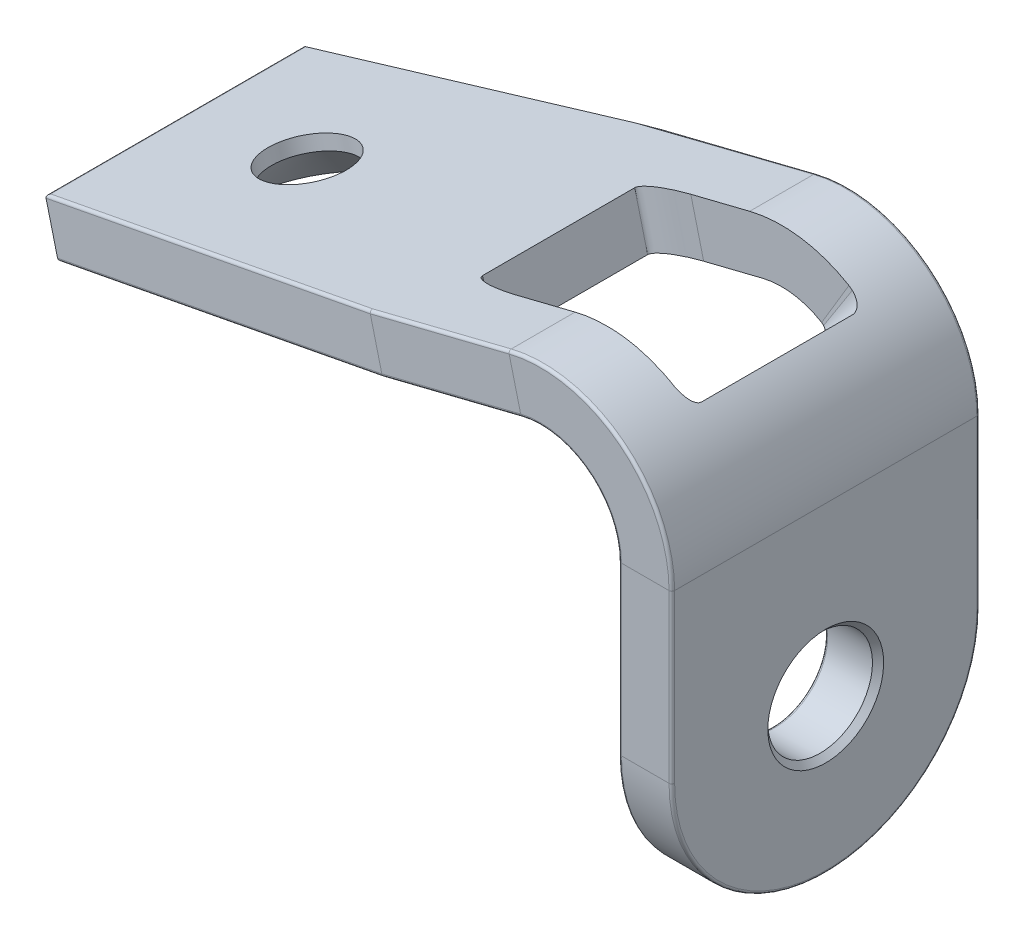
ISO-10303-21;
HEADER;
FILE_DESCRIPTION(('STEP AP214'),'2;1');
FILE_NAME('part.step','',(''),(''),'','','');
FILE_SCHEMA(('AUTOMOTIVE_DESIGN { 1 0 10303 214 1 1 1 1 }'));
ENDSEC;
DATA;
#1=APPLICATION_CONTEXT('core data for automotive mechanical design processes');
#2=APPLICATION_PROTOCOL_DEFINITION('international standard','automotive_design',2000,#1);
#3=PRODUCT_CONTEXT('',#1,'mechanical');
#4=PRODUCT('Part','Part','',(#3));
#5=PRODUCT_RELATED_PRODUCT_CATEGORY('part','',(#4));
#6=PRODUCT_DEFINITION_FORMATION('','',#4);
#7=PRODUCT_DEFINITION_CONTEXT('part definition',#1,'design');
#8=PRODUCT_DEFINITION('design','',#6,#7);
#9=PRODUCT_DEFINITION_SHAPE('','',#8);
#10=(LENGTH_UNIT() NAMED_UNIT(*) SI_UNIT(.MILLI.,.METRE.));
#11=(NAMED_UNIT(*) PLANE_ANGLE_UNIT() SI_UNIT($,.RADIAN.));
#12=(NAMED_UNIT(*) SI_UNIT($,.STERADIAN.) SOLID_ANGLE_UNIT());
#13=UNCERTAINTY_MEASURE_WITH_UNIT(LENGTH_MEASURE(1.E-05),#10,'distance_accuracy_value','');
#14=(GEOMETRIC_REPRESENTATION_CONTEXT(3) GLOBAL_UNCERTAINTY_ASSIGNED_CONTEXT((#13)) GLOBAL_UNIT_ASSIGNED_CONTEXT((#10,
#11,#12)) REPRESENTATION_CONTEXT('',''));
#15=CARTESIAN_POINT('',(0.,0.,0.));
#16=DIRECTION('',(0.,0.,1.));
#17=DIRECTION('',(1.,0.,0.));
#18=AXIS2_PLACEMENT_3D('',#15,#16,#17);
#19=CARTESIAN_POINT('',(-29.5746137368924,-7.37377937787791,6.985));
#20=DIRECTION('',(-0.241921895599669,0.970295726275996,0.));
#21=DIRECTION('',(-0.970295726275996,-0.241921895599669,0.));
#22=AXIS2_PLACEMENT_3D('',#19,#20,#21);
#23=PLANE('',#22);
#24=DIRECTION('',(0.,0.,-1.));
#25=VECTOR('',#24,1.);
#26=CARTESIAN_POINT('',(-7.41303179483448,-1.84827641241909,6.985));
#27=LINE('',#26,#25);
#28=CARTESIAN_POINT('',(-7.41303179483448,-1.84827641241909,-3.9624));
#29=VERTEX_POINT('',#28);
#30=CARTESIAN_POINT('',(-7.41303179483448,-1.84827641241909,-6.858));
#31=VERTEX_POINT('',#30);
#32=EDGE_CURVE('E673',#29,#31,#27,.T.);
#33=ORIENTED_EDGE('',*,*,#32,.T.);
#34=DIRECTION('',(0.970295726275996,0.241921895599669,0.));
#35=VECTOR('',#34,1.);
#36=CARTESIAN_POINT('',(-29.5746137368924,-7.37377937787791,-6.858));
#37=LINE('',#36,#35);
#38=CARTESIAN_POINT('',(-15.4767243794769,-3.85878078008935,-6.858));
#39=VERTEX_POINT('',#38);
#40=EDGE_CURVE('E563',#31,#39,#37,.F.);
#41=ORIENTED_EDGE('',*,*,#40,.T.);
#42=DIRECTION('',(0.967932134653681,0.24133258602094,-0.0697564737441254));
#43=VECTOR('',#42,1.);
#44=CARTESIAN_POINT('',(-29.5746137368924,-7.37377937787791,-5.842));
#45=LINE('',#44,#43);
#46=CARTESIAN_POINT('',(-29.4513861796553,-7.34305529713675,-5.85088070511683));
#47=VERTEX_POINT('',#46);
#48=EDGE_CURVE('E667',#47,#39,#45,.T.);
#49=ORIENTED_EDGE('',*,*,#48,.F.);
#50=DIRECTION('',(0.,0.,-1.));
#51=VECTOR('',#50,1.);
#52=CARTESIAN_POINT('',(-29.4513861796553,-7.34305529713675,6.985));
#53=LINE('',#52,#51);
#54=CARTESIAN_POINT('',(-29.4513861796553,-7.34305529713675,5.72357058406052));
#55=VERTEX_POINT('',#54);
#56=EDGE_CURVE('E561',#47,#55,#53,.F.);
#57=ORIENTED_EDGE('',*,*,#56,.T.);
#58=DIRECTION('',(-0.967932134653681,-0.24133258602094,-0.0697564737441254));
#59=VECTOR('',#58,1.);
#60=CARTESIAN_POINT('',(-13.7058922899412,-3.4172627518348,6.85830936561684));
#61=LINE('',#60,#59);
#62=CARTESIAN_POINT('',(-13.7101850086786,-3.41833304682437,6.858));
#63=VERTEX_POINT('',#62);
#64=EDGE_CURVE('E557',#55,#63,#61,.F.);
#65=ORIENTED_EDGE('',*,*,#64,.T.);
#66=DIRECTION('',(0.970295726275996,0.241921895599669,0.));
#67=VECTOR('',#66,1.);
#68=CARTESIAN_POINT('',(-7.41303179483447,-1.84827641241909,6.858));
#69=LINE('',#68,#67);
#70=CARTESIAN_POINT('',(-7.41303179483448,-1.84827641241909,6.858));
#71=VERTEX_POINT('',#70);
#72=EDGE_CURVE('E559',#63,#71,#69,.T.);
#73=ORIENTED_EDGE('',*,*,#72,.T.);
#74=CARTESIAN_POINT('',(-7.41303179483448,-1.84827641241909,3.96238698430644));
#75=VERTEX_POINT('',#74);
#76=EDGE_CURVE('E674',#71,#75,#27,.T.);
#77=ORIENTED_EDGE('',*,*,#76,.T.);
#78=DIRECTION('',(0.970295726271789,0.24192189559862,2.9449231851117E-06));
#79=VECTOR('',#78,1.);
#80=CARTESIAN_POINT('',(-10.1031959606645,-2.51900967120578,3.96238086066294));
#81=LINE('',#80,#79);
#82=CARTESIAN_POINT('',(-10.1031959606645,-2.51900967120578,3.96238086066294));
#83=VERTEX_POINT('',#82);
#84=EDGE_CURVE('E696',#83,#75,#81,.T.);
#85=ORIENTED_EDGE('',*,*,#84,.F.);
#86=CARTESIAN_POINT('',(-12.1229864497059,-3.02260000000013,3.4544));
#87=CARTESIAN_POINT('',(-12.1129489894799,-3.02009738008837,3.4892869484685));
#88=CARTESIAN_POINT('',(-12.0886081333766,-3.01402852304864,3.57388785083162));
#89=CARTESIAN_POINT('',(-11.952324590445,-2.98004921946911,3.66253303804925));
#90=CARTESIAN_POINT('',(-11.7683058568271,-2.93416819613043,3.74704652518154));
#91=CARTESIAN_POINT('',(-11.5166173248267,-2.87141519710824,3.82008171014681));
#92=CARTESIAN_POINT('',(-11.2141041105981,-2.79599018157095,3.88121871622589));
#93=CARTESIAN_POINT('',(-10.8683838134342,-2.70979243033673,3.92659778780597));
#94=CARTESIAN_POINT('',(-10.4934250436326,-2.61630470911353,3.95615665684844));
#95=CARTESIAN_POINT('',(-10.234910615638,-2.5518498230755,3.96027999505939));
#96=CARTESIAN_POINT('',(-10.1031959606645,-2.51900967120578,3.96238086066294));
#97=B_SPLINE_CURVE_WITH_KNOTS('',3,(#86,#87,#88,#89,#90,#91,#92,#93,#94,#95,#96),.UNSPECIFIED.,
.F.,.F.,(4,1,1,1,1,1,1,1,4),(0.,0.0478533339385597,0.11604440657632,0.210990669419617,
0.332345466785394,0.477005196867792,0.64034412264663,0.816753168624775,1.),.UNSPECIFIED.);
#98=CARTESIAN_POINT('',(-12.1229864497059,-3.02260000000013,3.4544));
#99=VERTEX_POINT('',#98);
#100=EDGE_CURVE('E280',#99,#83,#97,.T.);
#101=ORIENTED_EDGE('',*,*,#100,.F.);
#102=DIRECTION('',(0.,0.,1.));
#103=VECTOR('',#102,1.);
#104=CARTESIAN_POINT('',(-12.1229864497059,-3.02260000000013,-5.4737));
#105=LINE('',#104,#103);
#106=CARTESIAN_POINT('',(-12.1229864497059,-3.02260000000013,-3.4544));
#107=VERTEX_POINT('',#106);
#108=EDGE_CURVE('E262',#107,#99,#105,.T.);
#109=ORIENTED_EDGE('',*,*,#108,.F.);
#110=CARTESIAN_POINT('',(-10.0855097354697,-2.51460000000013,-3.9624));
#111=CARTESIAN_POINT('',(-10.2173344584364,-2.54746759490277,-3.9605808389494));
#112=CARTESIAN_POINT('',(-10.4762749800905,-2.61202871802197,-3.95700749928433));
#113=CARTESIAN_POINT('',(-10.85228161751,-2.70577770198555,-3.92824292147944));
#114=CARTESIAN_POINT('',(-11.1994129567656,-2.79232726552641,-3.88358246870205));
#115=CARTESIAN_POINT('',(-11.5046324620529,-2.86842703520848,-3.8231016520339));
#116=CARTESIAN_POINT('',(-11.7572427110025,-2.93140984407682,-3.75048102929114));
#117=CARTESIAN_POINT('',(-11.9483458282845,-2.97905720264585,-3.66655517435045));
#118=CARTESIAN_POINT('',(-12.0773789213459,-3.01122876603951,-3.577870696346));
#119=CARTESIAN_POINT('',(-12.122564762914,-3.02249486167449,-3.4932352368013));
#120=CARTESIAN_POINT('',(-12.122970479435,-3.02259601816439,-3.45587078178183));
#121=CARTESIAN_POINT('',(-12.1229864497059,-3.02260000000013,-3.4544));
#122=B_SPLINE_CURVE_WITH_KNOTS('',3,(#110,#111,#112,#113,#114,#115,#116,#117,#118,#119,#120,
#121),.UNSPECIFIED.,.F.,.F.,(4,1,1,1,1,1,1,1,1,4),(0.,0.181897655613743,0.357297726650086,
0.519998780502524,0.664403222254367,0.785870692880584,0.881238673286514,0.949991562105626,
0.998031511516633,1.),.UNSPECIFIED.);
#123=CARTESIAN_POINT('',(-10.0855097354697,-2.51460000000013,-3.9624));
#124=VERTEX_POINT('',#123);
#125=EDGE_CURVE('E751',#124,#107,#122,.T.);
#126=ORIENTED_EDGE('',*,*,#125,.F.);
#127=DIRECTION('',(-0.970295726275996,-0.241921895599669,0.));
#128=VECTOR('',#127,1.);
#129=CARTESIAN_POINT('',(-3.21911491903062,-0.802615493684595,-3.9624));
#130=LINE('',#129,#128);
#131=EDGE_CURVE('E689',#29,#124,#130,.T.);
#132=ORIENTED_EDGE('',*,*,#131,.F.);
#133=EDGE_LOOP('',(#33,#41,#49,#57,#65,#73,#77,#85,#101,#109,#126,#132));
#134=FACE_BOUND('',#133,.T.);
#135=CARTESIAN_POINT('',(-23.5364634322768,-5.86829942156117,0.));
#136=DIRECTION('',(-0.241921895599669,0.970295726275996,0.));
#137=DIRECTION('',(-0.970295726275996,-0.241921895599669,0.));
#138=AXIS2_PLACEMENT_3D('',#135,#136,#137);
#139=CIRCLE('',#138,1.8288);
#140=CARTESIAN_POINT('',(-25.3109402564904,-6.31072618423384,0.));
#141=VERTEX_POINT('',#140);
#142=EDGE_CURVE('E472',#141,#141,#139,.T.);
#143=ORIENTED_EDGE('',*,*,#142,.F.);
#144=EDGE_LOOP('',(#143));
#145=FACE_BOUND('',#144,.T.);
#146=ADVANCED_FACE('F43',(#134,#145),#23,.T.);
#147=CARTESIAN_POINT('',(-28.9908562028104,-9.71510296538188,6.985));
#148=DIRECTION('',(-0.241921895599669,0.970295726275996,0.));
#149=DIRECTION('',(-0.970295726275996,-0.241921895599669,0.));
#150=AXIS2_PLACEMENT_3D('',#147,#148,#149);
#151=PLANE('',#150);
#152=CARTESIAN_POINT('',(-22.9527058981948,-8.20962300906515,0.));
#153=DIRECTION('',(-0.241921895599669,0.970295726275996,0.));
#154=DIRECTION('',(-0.970295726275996,-0.241921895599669,0.));
#155=AXIS2_PLACEMENT_3D('',#152,#153,#154);
#156=CIRCLE('',#155,3.8608);
#157=CARTESIAN_POINT('',(-19.2065881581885,-7.27561095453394,0.));
#158=VERTEX_POINT('',#157);
#159=EDGE_CURVE('E492',#158,#158,#156,.T.);
#160=ORIENTED_EDGE('',*,*,#159,.T.);
#161=EDGE_LOOP('',(#160));
#162=FACE_BOUND('',#161,.T.);
#163=DIRECTION('',(-0.967932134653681,-0.24133258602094,0.0697564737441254));
#164=VECTOR('',#163,1.);
#165=CARTESIAN_POINT('',(-29.8483333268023,-9.92889602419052,-5.65289362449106));
#166=LINE('',#165,#164);
#167=CARTESIAN_POINT('',(-28.8676286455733,-9.68437888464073,-5.72357058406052));
#168=VERTEX_POINT('',#167);
#169=CARTESIAN_POINT('',(-13.1264274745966,-5.75965663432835,-6.858));
#170=VERTEX_POINT('',#169);
#171=EDGE_CURVE('E513',#168,#170,#166,.F.);
#172=ORIENTED_EDGE('',*,*,#171,.T.);
#173=DIRECTION('',(0.970295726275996,0.241921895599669,0.));
#174=VECTOR('',#173,1.);
#175=CARTESIAN_POINT('',(-6.82927426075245,-4.18959999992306,-6.858));
#176=LINE('',#175,#174);
#177=CARTESIAN_POINT('',(-6.82927426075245,-4.18959999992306,-6.858));
#178=VERTEX_POINT('',#177);
#179=EDGE_CURVE('E515',#170,#178,#176,.T.);
#180=ORIENTED_EDGE('',*,*,#179,.T.);
#181=DIRECTION('',(0.,0.,-1.));
#182=VECTOR('',#181,1.);
#183=CARTESIAN_POINT('',(-6.82927426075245,-4.18959999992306,6.985));
#184=LINE('',#183,#182);
#185=CARTESIAN_POINT('',(-6.82927426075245,-4.18959999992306,-3.9624));
#186=VERTEX_POINT('',#185);
#187=EDGE_CURVE('E462',#186,#178,#184,.T.);
#188=ORIENTED_EDGE('',*,*,#187,.F.);
#189=DIRECTION('',(-0.970295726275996,-0.241921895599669,0.));
#190=VECTOR('',#189,1.);
#191=CARTESIAN_POINT('',(-6.82927426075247,-4.18959999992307,-3.9624));
#192=LINE('',#191,#190);
#193=CARTESIAN_POINT('',(-9.50175220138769,-4.8559235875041,-3.9624));
#194=VERTEX_POINT('',#193);
#195=EDGE_CURVE('E747',#186,#194,#192,.T.);
#196=ORIENTED_EDGE('',*,*,#195,.T.);
#197=CARTESIAN_POINT('',(-9.50175220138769,-4.8559235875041,-3.9624));
#198=CARTESIAN_POINT('',(-9.6335769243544,-4.88879118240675,-3.9605808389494));
#199=CARTESIAN_POINT('',(-9.89251744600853,-4.95335230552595,-3.95700749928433));
#200=CARTESIAN_POINT('',(-10.268524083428,-5.04710128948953,-3.92824292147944));
#201=CARTESIAN_POINT('',(-10.6156554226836,-5.13365085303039,-3.88358246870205));
#202=CARTESIAN_POINT('',(-10.9208749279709,-5.20975062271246,-3.8231016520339));
#203=CARTESIAN_POINT('',(-11.1734851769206,-5.2727334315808,-3.75048102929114));
#204=CARTESIAN_POINT('',(-11.3645882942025,-5.32038079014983,-3.66655517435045));
#205=CARTESIAN_POINT('',(-11.4936213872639,-5.35255235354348,-3.577870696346));
#206=CARTESIAN_POINT('',(-11.538807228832,-5.36381844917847,-3.4932352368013));
#207=CARTESIAN_POINT('',(-11.539212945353,-5.36391960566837,-3.45587078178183));
#208=CARTESIAN_POINT('',(-11.5392289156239,-5.36392358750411,-3.4544));
#209=B_SPLINE_CURVE_WITH_KNOTS('',3,(#197,#198,#199,#200,#201,#202,#203,#204,#205,#206,#207,
#208),.UNSPECIFIED.,.F.,.F.,(4,1,1,1,1,1,1,1,1,4),(0.,0.181897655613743,0.357297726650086,
0.519998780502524,0.664403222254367,0.785870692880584,0.881238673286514,0.949991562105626,
0.998031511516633,1.),.UNSPECIFIED.);
#210=CARTESIAN_POINT('',(-11.5392289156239,-5.36392358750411,-3.4544));
#211=VERTEX_POINT('',#210);
#212=EDGE_CURVE('E279',#194,#211,#209,.T.);
#213=ORIENTED_EDGE('',*,*,#212,.T.);
#214=DIRECTION('',(0.,0.,1.));
#215=VECTOR('',#214,1.);
#216=CARTESIAN_POINT('',(-11.5392289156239,-5.36392358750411,-3.4544));
#217=LINE('',#216,#215);
#218=CARTESIAN_POINT('',(-11.5392289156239,-5.36392358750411,3.4544));
#219=VERTEX_POINT('',#218);
#220=EDGE_CURVE('E259',#211,#219,#217,.T.);
#221=ORIENTED_EDGE('',*,*,#220,.T.);
#222=CARTESIAN_POINT('',(-11.5392289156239,-5.36392358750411,3.4544));
#223=CARTESIAN_POINT('',(-11.5291914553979,-5.36142096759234,3.4892869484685));
#224=CARTESIAN_POINT('',(-11.5048505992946,-5.35535211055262,3.57388785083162));
#225=CARTESIAN_POINT('',(-11.368567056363,-5.32137280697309,3.66253303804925));
#226=CARTESIAN_POINT('',(-11.1845483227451,-5.2754917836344,3.74704652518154));
#227=CARTESIAN_POINT('',(-10.9328597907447,-5.21273878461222,3.82008171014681));
#228=CARTESIAN_POINT('',(-10.6303465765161,-5.13731376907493,3.88121871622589));
#229=CARTESIAN_POINT('',(-10.2846262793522,-5.0511160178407,3.92659778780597));
#230=CARTESIAN_POINT('',(-9.90966750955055,-4.95762829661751,3.95615665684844));
#231=CARTESIAN_POINT('',(-9.65115308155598,-4.89317341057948,3.96027999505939));
#232=CARTESIAN_POINT('',(-9.5194384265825,-4.86033325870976,3.96238086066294));
#233=B_SPLINE_CURVE_WITH_KNOTS('',3,(#222,#223,#224,#225,#226,#227,#228,#229,#230,#231,#232),
.UNSPECIFIED.,.F.,.F.,(4,1,1,1,1,1,1,1,4),(0.,0.0478533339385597,0.11604440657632,
0.210990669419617,0.332345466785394,0.477005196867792,0.64034412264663,0.816753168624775,1.),.UNSPECIFIED.);
#234=CARTESIAN_POINT('',(-9.5194384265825,-4.86033325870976,3.96238086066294));
#235=VERTEX_POINT('',#234);
#236=EDGE_CURVE('E267',#219,#235,#233,.T.);
#237=ORIENTED_EDGE('',*,*,#236,.T.);
#238=DIRECTION('',(0.970295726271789,0.24192189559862,2.9449231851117E-06));
#239=VECTOR('',#238,1.);
#240=CARTESIAN_POINT('',(-9.5194384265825,-4.86033325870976,3.96238086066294));
#241=LINE('',#240,#239);
#242=CARTESIAN_POINT('',(-6.82927426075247,-4.18959999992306,3.96238902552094));
#243=VERTEX_POINT('',#242);
#244=EDGE_CURVE('E688',#235,#243,#241,.T.);
#245=ORIENTED_EDGE('',*,*,#244,.T.);
#246=CARTESIAN_POINT('',(-6.82927426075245,-4.18959999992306,6.858));
#247=VERTEX_POINT('',#246);
#248=EDGE_CURVE('E467',#247,#243,#184,.T.);
#249=ORIENTED_EDGE('',*,*,#248,.F.);
#250=DIRECTION('',(0.970295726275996,0.241921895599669,0.));
#251=VECTOR('',#250,1.);
#252=CARTESIAN_POINT('',(-28.9908562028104,-9.71510296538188,6.858));
#253=LINE('',#252,#251);
#254=CARTESIAN_POINT('',(-13.1264274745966,-5.75965663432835,6.858));
#255=VERTEX_POINT('',#254);
#256=EDGE_CURVE('E509',#247,#255,#253,.F.);
#257=ORIENTED_EDGE('',*,*,#256,.T.);
#258=DIRECTION('',(0.967932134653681,0.24133258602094,0.0697564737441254));
#259=VECTOR('',#258,1.);
#260=CARTESIAN_POINT('',(-28.9050854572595,-9.69371791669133,5.72087116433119));
#261=LINE('',#260,#259);
#262=CARTESIAN_POINT('',(-28.8676286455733,-9.68437888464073,5.72357058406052));
#263=VERTEX_POINT('',#262);
#264=EDGE_CURVE('E507',#255,#263,#261,.F.);
#265=ORIENTED_EDGE('',*,*,#264,.T.);
#266=DIRECTION('',(0.,0.,-1.));
#267=VECTOR('',#266,1.);
#268=CARTESIAN_POINT('',(-28.8676286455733,-9.68437888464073,-5.842));
#269=LINE('',#268,#267);
#270=EDGE_CURVE('E511',#263,#168,#269,.T.);
#271=ORIENTED_EDGE('',*,*,#270,.T.);
#272=EDGE_LOOP('',(#172,#180,#188,#196,#213,#221,#237,#245,#249,#257,#265,#271));
#273=FACE_BOUND('',#272,.T.);
#274=ADVANCED_FACE('F276',(#162,#273),#151,.F.);
#275=CARTESIAN_POINT('',(-5.96900000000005,-7.63997160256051,17.1842572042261));
#276=DIRECTION('',(0.,0.,-1.));
#277=DIRECTION('',(-1.,0.,0.));
#278=AXIS2_PLACEMENT_3D('',#275,#276,#277);
#279=CYLINDRICAL_SURFACE('',#278,5.969);
#280=DIRECTION('',(0.,0.,-1.));
#281=VECTOR('',#280,1.);
#282=CARTESIAN_POINT('',(0.,-7.63997160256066,6.985));
#283=LINE('',#282,#281);
#284=CARTESIAN_POINT('',(0.,-7.63997160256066,6.858));
#285=VERTEX_POINT('',#284);
#286=CARTESIAN_POINT('',(0.,-7.63997160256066,-6.858));
#287=VERTEX_POINT('',#286);
#288=EDGE_CURVE('E476',#285,#287,#283,.T.);
#289=ORIENTED_EDGE('',*,*,#288,.T.);
#290=CARTESIAN_POINT('',(-5.96900000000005,-7.63997160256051,-6.858));
#291=DIRECTION('',(0.,0.,-1.));
#292=DIRECTION('',(-1.,0.,0.));
#293=AXIS2_PLACEMENT_3D('',#290,#291,#292);
#294=CIRCLE('',#293,5.969);
#295=EDGE_CURVE('E573',#287,#31,#294,.F.);
#296=ORIENTED_EDGE('',*,*,#295,.T.);
#297=ORIENTED_EDGE('',*,*,#32,.F.);
#298=CARTESIAN_POINT('',(-5.96900000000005,-7.63997160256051,-3.9624));
#299=DIRECTION('',(0.,0.,-1.));
#300=DIRECTION('',(1.,0.,0.));
#301=AXIS2_PLACEMENT_3D('',#298,#299,#300);
#302=CIRCLE('',#301,5.969);
#303=CARTESIAN_POINT('',(-2.90966560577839,-2.51460000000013,-3.9624));
#304=VERTEX_POINT('',#303);
#305=EDGE_CURVE('E685',#29,#304,#302,.T.);
#306=ORIENTED_EDGE('',*,*,#305,.T.);
#307=CARTESIAN_POINT('',(-2.90966560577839,-2.51460000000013,-3.9624));
#308=CARTESIAN_POINT('',(-2.90266759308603,-2.51877711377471,-3.96193039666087));
#309=CARTESIAN_POINT('',(-2.89567813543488,-2.52296856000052,-3.96146079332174));
#310=CARTESIAN_POINT('',(-2.88171644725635,-2.53138004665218,-3.96052158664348));
#311=CARTESIAN_POINT('',(-2.87474421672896,-2.53560008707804,-3.96005198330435));
#312=CARTESIAN_POINT('',(-2.8608170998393,-2.54406869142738,-3.9591127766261));
#313=CARTESIAN_POINT('',(-2.85386221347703,-2.54831725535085,-3.95864317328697));
#314=CARTESIAN_POINT('',(-2.83996990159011,-2.55684283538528,-3.95770396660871));
#315=CARTESIAN_POINT('',(-2.83303247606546,-2.56111985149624,-3.95723436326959));
#316=CARTESIAN_POINT('',(-2.81917520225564,-2.56970226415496,-3.95629515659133));
#317=CARTESIAN_POINT('',(-2.81225535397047,-2.57400766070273,-3.9558255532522));
#318=CARTESIAN_POINT('',(-2.79843335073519,-2.58264676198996,-3.95488634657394));
#319=CARTESIAN_POINT('',(-2.79153119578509,-2.58698046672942,-3.95441674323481));
#320=CARTESIAN_POINT('',(-2.77774469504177,-2.59567611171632,-3.95347753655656));
#321=CARTESIAN_POINT('',(-2.77086034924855,-2.60003805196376,-3.95300793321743));
#322=CARTESIAN_POINT('',(-2.75710958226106,-2.60879009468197,-3.95206872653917));
#323=CARTESIAN_POINT('',(-2.75024316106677,-2.61318019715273,-3.95159912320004));
#324=CARTESIAN_POINT('',(-2.74338575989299,-2.61758434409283,-3.95112951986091));
#325=B_SPLINE_CURVE_WITH_KNOTS('',3,(#307,#308,#309,#310,#311,#312,#313,#314,#315,#316,#317,
#318,#319,#320,#321,#322,#323,#324),.UNSPECIFIED.,.F.,.F.,(4,2,2,2,2,2,2,2,4),(0.,
0.0244901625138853,0.0489803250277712,0.0734704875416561,0.0979606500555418,0.122450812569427,
0.146940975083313,0.171431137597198,0.195921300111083),.UNSPECIFIED.);
#326=CARTESIAN_POINT('',(-2.74338575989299,-2.61758434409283,-3.95112951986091));
#327=VERTEX_POINT('',#326);
#328=EDGE_CURVE('E392',#304,#327,#325,.T.);
#329=ORIENTED_EDGE('',*,*,#328,.T.);
#330=CARTESIAN_POINT('',(-2.74338575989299,-2.61758434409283,-3.95112951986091));
#331=CARTESIAN_POINT('',(-2.71826467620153,-2.63371608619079,-3.94661331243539));
#332=CARTESIAN_POINT('',(-2.69334021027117,-2.64999213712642,-3.94138766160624));
#333=CARTESIAN_POINT('',(-2.64393818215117,-2.68277467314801,-3.92918823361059));
#334=CARTESIAN_POINT('',(-2.6194626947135,-2.69928180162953,-3.92220784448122));
#335=CARTESIAN_POINT('',(-2.57067069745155,-2.73271031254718,-3.90602169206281));
#336=CARTESIAN_POINT('',(-2.54636980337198,-2.74963274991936,-3.89676992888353));
#337=CARTESIAN_POINT('',(-2.49879542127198,-2.78327640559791,-3.87573232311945));
#338=CARTESIAN_POINT('',(-2.47552034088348,-2.79999790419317,-3.86395058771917));
#339=CARTESIAN_POINT('',(-2.42751293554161,-2.83499332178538,-3.83573085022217));
#340=CARTESIAN_POINT('',(-2.40295976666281,-2.85320144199,-3.81889583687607));
#341=CARTESIAN_POINT('',(-2.35651052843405,-2.88815930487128,-3.78094025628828));
#342=CARTESIAN_POINT('',(-2.3345985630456,-2.90491758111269,-3.75984760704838));
#343=CARTESIAN_POINT('',(-2.29398358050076,-2.93636815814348,-3.71274821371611));
#344=CARTESIAN_POINT('',(-2.27532764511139,-2.95102966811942,-3.68667923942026));
#345=CARTESIAN_POINT('',(-2.24254931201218,-2.97703575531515,-3.63028004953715));
#346=CARTESIAN_POINT('',(-2.22843217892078,-2.98837647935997,-3.5999449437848));
#347=CARTESIAN_POINT('',(-2.21012559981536,-3.00317337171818,-3.54996765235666));
#348=CARTESIAN_POINT('',(-2.2042698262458,-3.00792949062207,-3.53128218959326));
#349=CARTESIAN_POINT('',(-2.19413111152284,-3.01618906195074,-3.49326971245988));
#350=CARTESIAN_POINT('',(-2.18984429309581,-3.01969560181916,-3.47394441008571));
#351=CARTESIAN_POINT('',(-2.18629719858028,-3.02260000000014,-3.45439999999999));
#352=B_SPLINE_CURVE_WITH_KNOTS('',3,(#330,#331,#332,#333,#334,#335,#336,#337,#338,#339,#340,
#341,#342,#343,#344,#345,#346,#347,#348,#349,#350,#351),.UNSPECIFIED.,.F.,.F.,(4,2,2,2,2,2,2,2,
2,2,4),(0.,0.0906028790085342,0.181552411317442,0.274522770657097,0.367343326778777,
0.471716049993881,0.575425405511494,0.68052849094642,0.785753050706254,0.846104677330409,
0.906306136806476),.UNSPECIFIED.);
#353=CARTESIAN_POINT('',(-2.18629719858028,-3.02260000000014,-3.45439999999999));
#354=VERTEX_POINT('',#353);
#355=EDGE_CURVE('E362',#327,#354,#352,.T.);
#356=ORIENTED_EDGE('',*,*,#355,.T.);
#357=DIRECTION('',(0.,0.,1.));
#358=VECTOR('',#357,1.);
#359=CARTESIAN_POINT('',(-2.18629719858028,-3.02260000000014,3.45439999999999));
#360=LINE('',#359,#358);
#361=CARTESIAN_POINT('',(-2.18629719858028,-3.02260000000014,3.45439999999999));
#362=VERTEX_POINT('',#361);
#363=EDGE_CURVE('E435',#354,#362,#360,.T.);
#364=ORIENTED_EDGE('',*,*,#363,.T.);
#365=CARTESIAN_POINT('',(-2.18629719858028,-3.02260000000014,3.45439999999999));
#366=CARTESIAN_POINT('',(-2.18703736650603,-3.02199363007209,3.45904377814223));
#367=CARTESIAN_POINT('',(-2.18777768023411,-3.02138743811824,3.46368755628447));
#368=CARTESIAN_POINT('',(-2.18925859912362,-3.02017541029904,3.47297511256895));
#369=CARTESIAN_POINT('',(-2.18999920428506,-3.01956957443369,3.47761889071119));
#370=CARTESIAN_POINT('',(-2.19148070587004,-3.01835825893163,3.48690644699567));
#371=CARTESIAN_POINT('',(-2.19222160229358,-3.01775277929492,3.49155022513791));
#372=CARTESIAN_POINT('',(-2.19370368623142,-3.01654217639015,3.50083778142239));
#373=CARTESIAN_POINT('',(-2.19444487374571,-3.01593705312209,3.50548155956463));
#374=CARTESIAN_POINT('',(-2.19592753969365,-3.01472716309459,3.51476911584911));
#375=CARTESIAN_POINT('',(-2.19666901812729,-3.01412239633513,3.51941289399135));
#376=CARTESIAN_POINT('',(-2.19815226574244,-3.0129132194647,3.52870045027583));
#377=CARTESIAN_POINT('',(-2.19889403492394,-3.01230880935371,3.53334422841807));
#378=CARTESIAN_POINT('',(-2.20037786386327,-3.01110034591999,3.54263178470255));
#379=CARTESIAN_POINT('',(-2.20111992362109,-3.01049629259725,3.54727556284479));
#380=CARTESIAN_POINT('',(-2.20260433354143,-3.0092885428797,3.55656311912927));
#381=CARTESIAN_POINT('',(-2.20334668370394,-3.0086848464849,3.56120689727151));
#382=CARTESIAN_POINT('',(-2.20408917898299,-3.00808132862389,3.56585067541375));
#383=B_SPLINE_CURVE_WITH_KNOTS('',3,(#365,#366,#367,#368,#369,#370,#371,#372,#373,#374,#375,
#376,#377,#378,#379,#380,#381,#382),.UNSPECIFIED.,.F.,.F.,(4,2,2,2,2,2,2,2,4),(0.,
0.0142239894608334,0.0284479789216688,0.0426719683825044,0.0568959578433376,0.0711199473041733,
0.085343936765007,0.0995679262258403,0.113791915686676),.UNSPECIFIED.);
#384=CARTESIAN_POINT('',(-2.20408917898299,-3.00808132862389,3.56585067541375));
#385=VERTEX_POINT('',#384);
#386=EDGE_CURVE('E395',#362,#385,#383,.T.);
#387=ORIENTED_EDGE('',*,*,#386,.T.);
#388=CARTESIAN_POINT('',(-2.20408917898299,-3.00808132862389,3.56585067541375));
#389=CARTESIAN_POINT('',(-2.20955303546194,-3.00364041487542,3.57967115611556));
#390=CARTESIAN_POINT('',(-2.21553036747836,-2.99879773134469,3.59314997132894));
#391=CARTESIAN_POINT('',(-2.2284431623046,-2.98838424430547,3.61932277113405));
#392=CARTESIAN_POINT('',(-2.23537741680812,-2.982814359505,3.63201771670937));
#393=CARTESIAN_POINT('',(-2.25731977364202,-2.96528054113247,3.66846785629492));
#394=CARTESIAN_POINT('',(-2.27363052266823,-2.95235881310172,3.69099535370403));
#395=CARTESIAN_POINT('',(-2.31371319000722,-2.92100532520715,3.73801648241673));
#396=CARTESIAN_POINT('',(-2.3383132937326,-2.90202486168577,3.7614197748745));
#397=CARTESIAN_POINT('',(-2.39056514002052,-2.86243567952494,3.80312970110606));
#398=CARTESIAN_POINT('',(-2.41823481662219,-2.84181761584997,3.82140391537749));
#399=CARTESIAN_POINT('',(-2.47199748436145,-2.80252325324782,3.85166108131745));
#400=CARTESIAN_POINT('',(-2.4978710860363,-2.78391688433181,3.86413954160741));
#401=CARTESIAN_POINT('',(-2.55069709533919,-2.74658668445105,3.88637100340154));
#402=CARTESIAN_POINT('',(-2.57765044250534,-2.72786276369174,3.89612156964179));
#403=CARTESIAN_POINT('',(-2.65973734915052,-2.67186165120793,3.92205332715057));
#404=CARTESIAN_POINT('',(-2.71606244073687,-2.63478105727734,3.93489663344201));
#405=CARTESIAN_POINT('',(-2.79582233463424,-2.58422013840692,3.9485052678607));
#406=CARTESIAN_POINT('',(-2.81847624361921,-2.57007215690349,3.95187057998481));
#407=CARTESIAN_POINT('',(-2.86393490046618,-2.542105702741,3.95774254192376));
#408=CARTESIAN_POINT('',(-2.88673827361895,-2.52828590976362,3.96025351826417));
#409=CARTESIAN_POINT('',(-2.90966560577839,-2.51460000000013,3.9624));
#410=B_SPLINE_CURVE_WITH_KNOTS('',3,(#388,#389,#390,#391,#392,#393,#394,#395,#396,#397,#398,
#399,#400,#401,#402,#403,#404,#405,#406,#407,#408,#409),.UNSPECIFIED.,.F.,.F.,(4,2,2,2,2,2,2,2,
2,2,4),(0.,0.046499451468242,0.0929407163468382,0.18446921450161,0.300520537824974,
0.417289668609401,0.519815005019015,0.622431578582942,0.827805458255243,0.908561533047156,
0.988902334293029),.UNSPECIFIED.);
#411=CARTESIAN_POINT('',(-2.90966560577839,-2.51460000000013,3.9624));
#412=VERTEX_POINT('',#411);
#413=EDGE_CURVE('E397',#385,#412,#410,.T.);
#414=ORIENTED_EDGE('',*,*,#413,.T.);
#415=CARTESIAN_POINT('',(-2.90966560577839,-2.51460000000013,3.9624));
#416=CARTESIAN_POINT('',(-2.99321707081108,-2.46472575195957,3.96239977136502));
#417=CARTESIAN_POINT('',(-3.07798995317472,-2.41689810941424,3.96239954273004));
#418=CARTESIAN_POINT('',(-3.24977162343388,-2.32544248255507,3.96239908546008));
#419=CARTESIAN_POINT('',(-3.3367804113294,-2.28181449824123,3.9623988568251));
#420=CARTESIAN_POINT('',(-3.51282696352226,-2.19886463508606,3.96239839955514));
#421=CARTESIAN_POINT('',(-3.6018647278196,-2.15954275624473,3.96239817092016));
#422=CARTESIAN_POINT('',(-3.7817560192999,-2.08529856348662,3.9623977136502));
#423=CARTESIAN_POINT('',(-3.87260954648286,-2.05037624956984,3.96239748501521));
#424=CARTESIAN_POINT('',(-4.05591519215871,-1.98501484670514,3.96239702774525));
#425=CARTESIAN_POINT('',(-4.1483673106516,-1.95457575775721,3.96239679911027));
#426=CARTESIAN_POINT('',(-4.33464904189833,-1.89825355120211,3.96239634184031));
#427=CARTESIAN_POINT('',(-4.42847865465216,-1.87237043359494,3.96239611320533));
#428=CARTESIAN_POINT('',(-4.617291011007,-1.82522207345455,3.96239565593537));
#429=CARTESIAN_POINT('',(-4.712273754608,-1.80395683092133,3.96239542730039));
#430=CARTESIAN_POINT('',(-4.90316524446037,-1.76609506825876,3.96239497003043));
#431=CARTESIAN_POINT('',(-4.99907399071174,-1.7494985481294,3.96239474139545));
#432=CARTESIAN_POINT('',(-5.19158814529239,-1.72101391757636,3.96239428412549));
#433=CARTESIAN_POINT('',(-5.28819355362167,-1.70912580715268,3.96239405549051));
#434=CARTESIAN_POINT('',(-5.48187002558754,-1.69008642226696,3.96239359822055));
#435=CARTESIAN_POINT('',(-5.57894108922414,-1.68293514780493,3.96239336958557));
#436=CARTESIAN_POINT('',(-5.77331675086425,-1.6733865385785,3.9623929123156));
#437=CARTESIAN_POINT('',(-5.87062134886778,-1.67098920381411,3.96239268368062));
#438=CARTESIAN_POINT('',(-6.06523140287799,-1.6709541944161,3.96239222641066));
#439=CARTESIAN_POINT('',(-6.16253685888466,-1.67331651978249,3.96239199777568));
#440=CARTESIAN_POINT('',(-6.35691593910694,-1.68279522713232,3.96239154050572));
#441=CARTESIAN_POINT('',(-6.45398956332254,-1.68991160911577,3.96239131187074));
#442=CARTESIAN_POINT('',(-6.6476728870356,-1.70888124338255,3.96239085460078));
#443=CARTESIAN_POINT('',(-6.74428258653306,-1.72073449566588,3.9623906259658));
#444=CARTESIAN_POINT('',(-6.93680691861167,-1.7491501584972,3.96239016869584));
#445=CARTESIAN_POINT('',(-7.03272155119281,-1.76571256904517,3.96238994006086));
#446=CARTESIAN_POINT('',(-7.22362686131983,-1.80350458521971,3.9623894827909));
#447=CARTESIAN_POINT('',(-7.31861753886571,-1.82473419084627,3.96238925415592));
#448=CARTESIAN_POINT('',(-7.41303179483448,-1.84827641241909,3.96238902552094));
#449=B_SPLINE_CURVE_WITH_KNOTS('',3,(#415,#416,#417,#418,#419,#420,#421,#422,#423,#424,#425,
#426,#427,#428,#429,#430,#431,#432,#433,#434,#435,#436,#437,#438,#439,#440,#441,#442,#443,#444,
#445,#446,#447,#448),.UNSPECIFIED.,.F.,.F.,(4,2,2,2,2,2,2,2,2,2,2,2,2,2,2,2,4),(0.,
0.291886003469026,0.583772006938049,0.875658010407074,1.1675440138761,1.45943001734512,
1.75131602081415,2.04320202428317,2.3350880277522,2.62697403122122,2.91886003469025,
3.21074603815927,3.5026320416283,3.79451804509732,4.08640404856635,4.37829005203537,
4.6701760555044),.UNSPECIFIED.);
#450=EDGE_CURVE('E385',#412,#75,#449,.T.);
#451=ORIENTED_EDGE('',*,*,#450,.T.);
#452=ORIENTED_EDGE('',*,*,#76,.F.);
#453=CARTESIAN_POINT('',(-5.96900000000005,-7.63997160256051,6.858));
#454=DIRECTION('',(0.,0.,1.));
#455=DIRECTION('',(1.,0.,0.));
#456=AXIS2_PLACEMENT_3D('',#453,#454,#455);
#457=CIRCLE('',#456,5.969);
#458=EDGE_CURVE('E571',#71,#285,#457,.F.);
#459=ORIENTED_EDGE('',*,*,#458,.T.);
#460=EDGE_LOOP('',(#289,#296,#297,#306,#329,#356,#364,#387,#414,#451,#452,#459));
#461=FACE_BOUND('',#460,.T.);
#462=ADVANCED_FACE('F712',(#461),#279,.T.);
#463=CARTESIAN_POINT('',(-5.96900000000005,-7.63997160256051,17.1842572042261));
#464=DIRECTION('',(0.,0.,-1.));
#465=DIRECTION('',(-1.,0.,0.));
#466=AXIS2_PLACEMENT_3D('',#463,#464,#465);
#467=CYLINDRICAL_SURFACE('',#466,3.556);
#468=ORIENTED_EDGE('',*,*,#187,.T.);
#469=CARTESIAN_POINT('',(-5.96900000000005,-7.63997160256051,-6.858));
#470=DIRECTION('',(0.,0.,-1.));
#471=DIRECTION('',(-1.,0.,0.));
#472=AXIS2_PLACEMENT_3D('',#469,#470,#471);
#473=CIRCLE('',#472,3.556);
#474=CARTESIAN_POINT('',(-2.41300000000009,-7.63997160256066,-6.858));
#475=VERTEX_POINT('',#474);
#476=EDGE_CURVE('E530',#178,#475,#473,.T.);
#477=ORIENTED_EDGE('',*,*,#476,.T.);
#478=DIRECTION('',(0.,0.,-1.));
#479=VECTOR('',#478,1.);
#480=CARTESIAN_POINT('',(-2.41300000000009,-7.63997160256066,6.985));
#481=LINE('',#480,#479);
#482=CARTESIAN_POINT('',(-2.41300000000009,-7.63997160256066,6.858));
#483=VERTEX_POINT('',#482);
#484=EDGE_CURVE('E483',#483,#475,#481,.T.);
#485=ORIENTED_EDGE('',*,*,#484,.F.);
#486=CARTESIAN_POINT('',(-5.96900000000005,-7.63997160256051,6.858));
#487=DIRECTION('',(0.,0.,1.));
#488=DIRECTION('',(1.,0.,0.));
#489=AXIS2_PLACEMENT_3D('',#486,#487,#488);
#490=CIRCLE('',#489,3.556);
#491=EDGE_CURVE('E528',#483,#247,#490,.T.);
#492=ORIENTED_EDGE('',*,*,#491,.T.);
#493=ORIENTED_EDGE('',*,*,#248,.T.);
#494=CARTESIAN_POINT('',(-4.14641780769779,-4.58655873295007,3.9624));
#495=CARTESIAN_POINT('',(-4.19619314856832,-4.55684641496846,3.96239977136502));
#496=CARTESIAN_POINT('',(-4.24669614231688,-4.52835335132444,3.96239954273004));
#497=CARTESIAN_POINT('',(-4.34903415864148,-4.47386914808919,3.96239908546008));
#498=CARTESIAN_POINT('',(-4.40086918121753,-4.44787800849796,3.9623988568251));
#499=CARTESIAN_POINT('',(-4.5057479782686,-4.39846106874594,3.96239839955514));
#500=CARTESIAN_POINT('',(-4.55879175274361,-4.37503526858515,3.96239817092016));
#501=CARTESIAN_POINT('',(-4.66596103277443,-4.33080468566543,3.9623977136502));
#502=CARTESIAN_POINT('',(-4.72008653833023,-4.3099999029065,3.96239748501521));
#503=CARTESIAN_POINT('',(-4.82928990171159,-4.27106119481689,3.96239702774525));
#504=CARTESIAN_POINT('',(-4.88436775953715,-4.2529272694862,3.96239679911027));
#505=CARTESIAN_POINT('',(-4.99534411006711,-4.21937361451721,3.96239634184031));
#506=CARTESIAN_POINT('',(-5.05124260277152,-4.20395388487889,3.96239611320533));
#507=CARTESIAN_POINT('',(-5.16372655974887,-4.17586550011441,3.96239565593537));
#508=CARTESIAN_POINT('',(-5.22031202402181,-4.16319684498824,3.96239542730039));
#509=CARTESIAN_POINT('',(-5.33403461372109,-4.14064090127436,3.96239497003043));
#510=CARTESIAN_POINT('',(-5.39117173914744,-4.13075361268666,3.96239474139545));
#511=CARTESIAN_POINT('',(-5.5058610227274,-4.11378404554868,3.96239428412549));
#512=CARTESIAN_POINT('',(-5.56341318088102,-4.1067017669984,3.96239405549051));
#513=CARTESIAN_POINT('',(-5.67879490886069,-4.09535915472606,3.96239359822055));
#514=CARTESIAN_POINT('',(-5.73662447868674,-4.091098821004,3.96239336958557));
#515=CARTESIAN_POINT('',(-5.85242274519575,-4.08541028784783,3.9623929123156));
#516=CARTESIAN_POINT('',(-5.9103914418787,-4.08398208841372,3.96239268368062));
#517=CARTESIAN_POINT('',(-6.02632934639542,-4.08396123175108,3.96239222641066));
#518=CARTESIAN_POINT('',(-6.08429855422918,-4.08536857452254,3.96239199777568));
#519=CARTESIAN_POINT('',(-6.20009885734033,-4.09101546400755,3.96239154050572));
#520=CARTESIAN_POINT('',(-6.25792995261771,-4.09525501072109,3.96239131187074));
#521=CARTESIAN_POINT('',(-6.37331576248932,-4.10655606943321,3.96239085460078));
#522=CARTESIAN_POINT('',(-6.43087047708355,-4.1136175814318,3.9623906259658));
#523=CARTESIAN_POINT('',(-6.54556582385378,-4.13054606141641,3.96239016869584));
#524=CARTESIAN_POINT('',(-6.60270645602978,-4.14041302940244,3.96238994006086));
#525=CARTESIAN_POINT('',(-6.71643727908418,-4.16292742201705,3.9623894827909));
#526=CARTESIAN_POINT('',(-6.77302746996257,-4.17557484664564,3.96238925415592));
#527=CARTESIAN_POINT('',(-6.82927426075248,-4.18959999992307,3.96238902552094));
#528=B_SPLINE_CURVE_WITH_KNOTS('',3,(#494,#495,#496,#497,#498,#499,#500,#501,#502,#503,#504,
#505,#506,#507,#508,#509,#510,#511,#512,#513,#514,#515,#516,#517,#518,#519,#520,#521,#522,#523,
#524,#525,#526,#527),.UNSPECIFIED.,.F.,.F.,(4,2,2,2,2,2,2,2,2,2,2,2,2,2,2,2,4),(0.,
0.173889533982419,0.347779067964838,0.521668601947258,0.695558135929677,0.869447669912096,
1.04333720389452,1.21722673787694,1.39111627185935,1.56500580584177,1.73889533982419,
1.91278487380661,2.08667440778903,2.26056394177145,2.43445347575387,2.60834300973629,
2.78223254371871),.UNSPECIFIED.);
#529=CARTESIAN_POINT('',(-4.14641780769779,-4.58655873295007,3.9624));
#530=VERTEX_POINT('',#529);
#531=EDGE_CURVE('E404',#530,#243,#528,.T.);
#532=ORIENTED_EDGE('',*,*,#531,.F.);
#533=CARTESIAN_POINT('',(-3.72607440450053,-4.88054760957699,3.56585067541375));
#534=CARTESIAN_POINT('',(-3.72952481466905,-4.87774376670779,3.58048247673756));
#535=CARTESIAN_POINT('',(-3.73336432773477,-4.87463287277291,3.594963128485));
#536=CARTESIAN_POINT('',(-3.74189346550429,-4.86775888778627,3.62353353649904));
#537=CARTESIAN_POINT('',(-3.74658418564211,-4.86399495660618,3.63762276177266));
#538=CARTESIAN_POINT('',(-3.76202510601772,-4.85167945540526,3.67910979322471));
#539=CARTESIAN_POINT('',(-3.77414494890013,-4.84210344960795,3.70573090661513));
#540=CARTESIAN_POINT('',(-3.80230934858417,-4.82023679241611,3.75589073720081));
#541=CARTESIAN_POINT('',(-3.81838282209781,-4.80792620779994,3.77940468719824));
#542=CARTESIAN_POINT('',(-3.85399855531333,-4.78123130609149,3.82212184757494));
#543=CARTESIAN_POINT('',(-3.87353233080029,-4.7668520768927,3.84133534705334));
#544=CARTESIAN_POINT('',(-3.91758941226,-4.7352064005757,3.87708264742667));
#545=CARTESIAN_POINT('',(-3.94242429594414,-4.71779602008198,3.89309795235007));
#546=CARTESIAN_POINT('',(-3.99442840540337,-4.68240532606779,3.92010844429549));
#547=CARTESIAN_POINT('',(-4.02160732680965,-4.6644228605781,3.93108146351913));
#548=CARTESIAN_POINT('',(-4.06531543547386,-4.63639421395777,3.94494897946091));
#549=CARTESIAN_POINT('',(-4.08137108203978,-4.62627669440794,3.94928535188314));
#550=CARTESIAN_POINT('',(-4.11371329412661,-4.60625990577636,3.95671418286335));
#551=CARTESIAN_POINT('',(-4.12999686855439,-4.59635952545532,3.9598165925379));
#552=CARTESIAN_POINT('',(-4.14641780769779,-4.58655873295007,3.9624));
#553=B_SPLINE_CURVE_WITH_KNOTS('',3,(#533,#534,#535,#536,#537,#538,#539,#540,#541,#542,#543,
#544,#545,#546,#547,#548,#549,#550,#551,#552),.UNSPECIFIED.,.F.,.F.,(4,2,2,2,2,2,2,2,2,4),(0.,
0.0458629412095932,0.0917853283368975,0.183617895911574,0.276143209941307,0.368444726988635,
0.470782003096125,0.573564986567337,0.63192981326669,0.689813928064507),.UNSPECIFIED.);
#554=CARTESIAN_POINT('',(-3.72607440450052,-4.880547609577,3.56585067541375));
#555=VERTEX_POINT('',#554);
#556=EDGE_CURVE('E422',#555,#530,#553,.T.);
#557=ORIENTED_EDGE('',*,*,#556,.F.);
#558=CARTESIAN_POINT('',(-3.7154749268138,-4.88919703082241,3.45439999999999));
#559=CARTESIAN_POINT('',(-3.71591587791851,-4.88883578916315,3.45904377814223));
#560=CARTESIAN_POINT('',(-3.71635691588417,-4.88847465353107,3.46368755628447));
#561=CARTESIAN_POINT('',(-3.71723916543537,-4.88775259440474,3.47297511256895));
#562=CARTESIAN_POINT('',(-3.71768037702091,-4.88739167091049,3.47761889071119));
#563=CARTESIAN_POINT('',(-3.71856297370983,-4.8866700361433,3.48690644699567));
#564=CARTESIAN_POINT('',(-3.71900435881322,-4.88630932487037,3.49155022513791));
#565=CARTESIAN_POINT('',(-3.71988730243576,-4.88558811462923,3.50083778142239));
#566=CARTESIAN_POINT('',(-3.72032886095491,-4.88522761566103,3.50548155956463));
#567=CARTESIAN_POINT('',(-3.72121215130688,-4.88450683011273,3.51476911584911));
#568=CARTESIAN_POINT('',(-3.72165388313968,-4.88414654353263,3.51941289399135));
#569=CARTESIAN_POINT('',(-3.72253752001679,-4.88342618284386,3.52870045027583));
#570=CARTESIAN_POINT('',(-3.72297942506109,-4.88306610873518,3.53334422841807));
#571=CARTESIAN_POINT('',(-3.72386340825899,-4.88234617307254,3.54263178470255));
#572=CARTESIAN_POINT('',(-3.72430548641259,-4.88198631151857,3.54727556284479));
#573=CARTESIAN_POINT('',(-3.72518981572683,-4.88126680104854,3.55656311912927));
#574=CARTESIAN_POINT('',(-3.72563206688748,-4.88090715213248,3.56120689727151));
#575=CARTESIAN_POINT('',(-3.72607440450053,-4.88054760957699,3.56585067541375));
#576=B_SPLINE_CURVE_WITH_KNOTS('',3,(#558,#559,#560,#561,#562,#563,#564,#565,#566,#567,#568,
#569,#570,#571,#572,#573,#574,#575),.UNSPECIFIED.,.F.,.F.,(4,2,2,2,2,2,2,2,4),(0.,
0.0140358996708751,0.028071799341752,0.0421076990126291,0.0561435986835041,0.0701794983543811,
0.0842153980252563,0.0982512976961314,0.112287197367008),.UNSPECIFIED.);
#577=CARTESIAN_POINT('',(-3.7154749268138,-4.88919703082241,3.45439999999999));
#578=VERTEX_POINT('',#577);
#579=EDGE_CURVE('E430',#578,#555,#576,.T.);
#580=ORIENTED_EDGE('',*,*,#579,.F.);
#581=DIRECTION('',(0.,0.,-1.));
#582=VECTOR('',#581,1.);
#583=CARTESIAN_POINT('',(-3.7154749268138,-4.88919703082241,11.7105572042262));
#584=LINE('',#583,#582);
#585=CARTESIAN_POINT('',(-3.7154749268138,-4.88919703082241,-3.45439999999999));
#586=VERTEX_POINT('',#585);
#587=EDGE_CURVE('E370',#586,#578,#584,.F.);
#588=ORIENTED_EDGE('',*,*,#587,.F.);
#589=CARTESIAN_POINT('',(-4.04735747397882,-4.64791110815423,-3.95112951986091));
#590=CARTESIAN_POINT('',(-4.03509556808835,-4.65578575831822,-3.94743775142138));
#591=CARTESIAN_POINT('',(-4.02298294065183,-4.66367223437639,-3.94327761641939));
#592=CARTESIAN_POINT('',(-3.99911538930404,-4.67941505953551,-3.93392852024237));
#593=CARTESIAN_POINT('',(-3.98736100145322,-4.68727134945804,-3.92873809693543));
#594=CARTESIAN_POINT('',(-3.9527128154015,-4.71072303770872,-3.91146887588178));
#595=CARTESIAN_POINT('',(-3.93050252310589,-4.72615707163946,-3.89771153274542));
#596=CARTESIAN_POINT('',(-3.8886367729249,-4.75589594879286,-3.86532247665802));
#597=CARTESIAN_POINT('',(-3.86900487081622,-4.77018996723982,-3.84664995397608));
#598=CARTESIAN_POINT('',(-3.83336432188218,-4.79661262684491,-3.80499960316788));
#599=CARTESIAN_POINT('',(-3.81734172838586,-4.80874956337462,-3.78203899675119));
#600=CARTESIAN_POINT('',(-3.79080608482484,-4.82912590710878,-3.73585172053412));
#601=CARTESIAN_POINT('',(-3.77986021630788,-4.83765965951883,-3.71299610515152));
#602=CARTESIAN_POINT('',(-3.76066251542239,-4.85276320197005,-3.66546961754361));
#603=CARTESIAN_POINT('',(-3.75242242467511,-4.859324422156,-3.64079138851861));
#604=CARTESIAN_POINT('',(-3.73807309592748,-4.8708216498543,-3.58940264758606));
#605=CARTESIAN_POINT('',(-3.73205930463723,-4.87568444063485,-3.56265041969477));
#606=CARTESIAN_POINT('',(-3.72225083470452,-4.8836546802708,-3.50875837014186));
#607=CARTESIAN_POINT('',(-3.71843455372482,-4.8867792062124,-3.48162510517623));
#608=CARTESIAN_POINT('',(-3.7154749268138,-4.88919703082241,-3.45439999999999));
#609=B_SPLINE_CURVE_WITH_KNOTS('',3,(#589,#590,#591,#592,#593,#594,#595,#596,#597,#598,#599,
#600,#601,#602,#603,#604,#605,#606,#607,#608),.UNSPECIFIED.,.F.,.F.,(4,2,2,2,2,2,2,2,2,4),(0.,
0.0450858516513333,0.0902361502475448,0.180785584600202,0.272111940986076,0.3630791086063,
0.442997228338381,0.523257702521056,0.606642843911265,0.689193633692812),.UNSPECIFIED.);
#610=CARTESIAN_POINT('',(-4.04735747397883,-4.64791110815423,-3.95112951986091));
#611=VERTEX_POINT('',#610);
#612=EDGE_CURVE('E353',#611,#586,#609,.T.);
#613=ORIENTED_EDGE('',*,*,#612,.F.);
#614=CARTESIAN_POINT('',(-4.14641780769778,-4.58655873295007,-3.9624));
#615=CARTESIAN_POINT('',(-4.14224877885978,-4.58904722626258,-3.96193039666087));
#616=CARTESIAN_POINT('',(-4.13808484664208,-4.59154425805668,-3.96146079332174));
#617=CARTESIAN_POINT('',(-4.12976724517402,-4.59655535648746,-3.96052158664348));
#618=CARTESIAN_POINT('',(-4.12561357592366,-4.59906942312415,-3.96005198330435));
#619=CARTESIAN_POINT('',(-4.11731657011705,-4.60411454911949,-3.9591127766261));
#620=CARTESIAN_POINT('',(-4.11317323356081,-4.60664560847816,-3.95864317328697));
#621=CARTESIAN_POINT('',(-4.10489696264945,-4.61172467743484,-3.95770396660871));
#622=CARTESIAN_POINT('',(-4.10076402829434,-4.61427268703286,-3.95723436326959));
#623=CARTESIAN_POINT('',(-4.09250863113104,-4.61938561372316,-3.95629515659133));
#624=CARTESIAN_POINT('',(-4.08838616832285,-4.62195053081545,-3.9558255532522));
#625=CARTESIAN_POINT('',(-4.08015178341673,-4.62709722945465,-3.95488634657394));
#626=CARTESIAN_POINT('',(-4.0760398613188,-4.62967901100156,-3.95441674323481));
#627=CARTESIAN_POINT('',(-4.06782662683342,-4.63485939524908,-3.95347753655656));
#628=CARTESIAN_POINT('',(-4.06372531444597,-4.63745799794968,-3.95300793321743));
#629=CARTESIAN_POINT('',(-4.05553336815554,-4.64267198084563,-3.95206872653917));
#630=CARTESIAN_POINT('',(-4.05144273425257,-4.64528736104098,-3.95159912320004));
#631=CARTESIAN_POINT('',(-4.04735747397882,-4.64791110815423,-3.95112951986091));
#632=B_SPLINE_CURVE_WITH_KNOTS('',3,(#614,#615,#616,#617,#618,#619,#620,#621,#622,#623,#624,
#625,#626,#627,#628,#629,#630,#631),.UNSPECIFIED.,.F.,.F.,(4,2,2,2,2,2,2,2,4),(0.,
0.0146336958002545,0.0292673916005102,0.0439010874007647,0.0585347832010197,0.0731684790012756,
0.087802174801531,0.102435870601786,0.11706956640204),.UNSPECIFIED.);
#633=CARTESIAN_POINT('',(-4.14641780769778,-4.58655873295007,-3.9624));
#634=VERTEX_POINT('',#633);
#635=EDGE_CURVE('E443',#634,#611,#632,.T.);
#636=ORIENTED_EDGE('',*,*,#635,.F.);
#637=CARTESIAN_POINT('',(-5.96900000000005,-7.63997160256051,-3.9624));
#638=DIRECTION('',(0.,0.,-1.));
#639=DIRECTION('',(-1.,0.,0.));
#640=AXIS2_PLACEMENT_3D('',#637,#638,#639);
#641=CIRCLE('',#640,3.556);
#642=EDGE_CURVE('E686',#186,#634,#641,.T.);
#643=ORIENTED_EDGE('',*,*,#642,.F.);
#644=EDGE_LOOP('',(#468,#477,#485,#492,#493,#532,#557,#580,#588,#613,#636,#643));
#645=FACE_BOUND('',#644,.T.);
#646=ADVANCED_FACE('F715',(#645),#467,.F.);
#647=CARTESIAN_POINT('',(-2.41300000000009,-15.2146000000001,0.));
#648=DIRECTION('',(-1.,0.,0.));
#649=DIRECTION('',(0.,0.,1.));
#650=AXIS2_PLACEMENT_3D('',#647,#648,#649);
#651=CYLINDRICAL_SURFACE('',#650,6.985);
#652=DIRECTION('',(-1.,0.,0.));
#653=VECTOR('',#652,1.);
#654=CARTESIAN_POINT('',(-6.82927426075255,-15.2146000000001,6.985));
#655=LINE('',#654,#653);
#656=CARTESIAN_POINT('',(-2.28600000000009,-15.2146000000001,6.985));
#657=VERTEX_POINT('',#656);
#658=CARTESIAN_POINT('',(-0.127000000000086,-15.2146000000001,6.985));
#659=VERTEX_POINT('',#658);
#660=EDGE_CURVE('E495',#657,#659,#655,.F.);
#661=ORIENTED_EDGE('',*,*,#660,.F.);
#662=CARTESIAN_POINT('',(-2.28600000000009,-15.2146000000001,0.));
#663=DIRECTION('',(1.,0.,0.));
#664=DIRECTION('',(0.,1.,0.));
#665=AXIS2_PLACEMENT_3D('',#662,#663,#664);
#666=CIRCLE('',#665,6.985);
#667=CARTESIAN_POINT('',(-2.28600000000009,-15.2146000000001,-6.985));
#668=VERTEX_POINT('',#667);
#669=EDGE_CURVE('E547',#657,#668,#666,.T.);
#670=ORIENTED_EDGE('',*,*,#669,.T.);
#671=DIRECTION('',(-1.,0.,0.));
#672=VECTOR('',#671,1.);
#673=CARTESIAN_POINT('',(-5.96900000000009,-15.2146000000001,-6.985));
#674=LINE('',#673,#672);
#675=CARTESIAN_POINT('',(-0.127000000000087,-15.2146000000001,-6.985));
#676=VERTEX_POINT('',#675);
#677=EDGE_CURVE('E498',#676,#668,#674,.T.);
#678=ORIENTED_EDGE('',*,*,#677,.F.);
#679=CARTESIAN_POINT('',(-0.127000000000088,-15.2146000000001,0.));
#680=DIRECTION('',(1.,0.,0.));
#681=DIRECTION('',(0.,1.,0.));
#682=AXIS2_PLACEMENT_3D('',#679,#680,#681);
#683=CIRCLE('',#682,6.985);
#684=EDGE_CURVE('E545',#676,#659,#683,.F.);
#685=ORIENTED_EDGE('',*,*,#684,.T.);
#686=EDGE_LOOP('',(#661,#670,#678,#685));
#687=FACE_BOUND('',#686,.T.);
#688=ADVANCED_FACE('F835',(#687),#651,.T.);
#689=CARTESIAN_POINT('',(-6.82927426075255,-4.18959999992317,6.985));
#690=DIRECTION('',(0.,0.,1.));
#691=DIRECTION('',(1.,0.,0.));
#692=AXIS2_PLACEMENT_3D('',#689,#690,#691);
#693=PLANE('',#692);
#694=DIRECTION('',(-1.,0.,0.));
#695=VECTOR('',#694,1.);
#696=CARTESIAN_POINT('',(0.,-7.63997160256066,6.985));
#697=LINE('',#696,#695);
#698=CARTESIAN_POINT('',(-0.127000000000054,-7.63997160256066,6.985));
#699=VERTEX_POINT('',#698);
#700=CARTESIAN_POINT('',(-2.28600000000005,-7.63997160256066,6.985));
#701=VERTEX_POINT('',#700);
#702=EDGE_CURVE('E486',#699,#701,#697,.T.);
#703=ORIENTED_EDGE('',*,*,#702,.T.);
#704=DIRECTION('',(0.,-1.,0.));
#705=VECTOR('',#704,1.);
#706=CARTESIAN_POINT('',(-2.28600000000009,-15.2146000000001,6.985));
#707=LINE('',#706,#705);
#708=EDGE_CURVE('E551',#701,#657,#707,.T.);
#709=ORIENTED_EDGE('',*,*,#708,.T.);
#710=ORIENTED_EDGE('',*,*,#660,.T.);
#711=DIRECTION('',(0.,-1.,0.));
#712=VECTOR('',#711,1.);
#713=CARTESIAN_POINT('',(-0.127000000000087,-4.18959999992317,6.985));
#714=LINE('',#713,#712);
#715=EDGE_CURVE('E549',#659,#699,#714,.F.);
#716=ORIENTED_EDGE('',*,*,#715,.T.);
#717=EDGE_LOOP('',(#703,#709,#710,#716));
#718=FACE_BOUND('',#717,.T.);
#719=ADVANCED_FACE('F832',(#718),#693,.T.);
#720=CARTESIAN_POINT('',(-2.41300000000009,-7.63997160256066,6.985));
#721=DIRECTION('',(1.,0.,0.));
#722=DIRECTION('',(0.,1.,0.));
#723=AXIS2_PLACEMENT_3D('',#720,#721,#722);
#724=PLANE('',#723);
#725=CARTESIAN_POINT('',(-2.41300000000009,-15.2146000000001,0.));
#726=DIRECTION('',(1.,0.,0.));
#727=DIRECTION('',(0.,1.,0.));
#728=AXIS2_PLACEMENT_3D('',#725,#726,#727);
#729=CIRCLE('',#728,2.5019);
#730=CARTESIAN_POINT('',(-2.41300000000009,-12.7127000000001,0.));
#731=VERTEX_POINT('',#730);
#732=EDGE_CURVE('E532',#731,#731,#729,.T.);
#733=ORIENTED_EDGE('',*,*,#732,.T.);
#734=EDGE_LOOP('',(#733));
#735=FACE_BOUND('',#734,.T.);
#736=ORIENTED_EDGE('',*,*,#484,.T.);
#737=DIRECTION('',(0.,-1.,0.));
#738=VECTOR('',#737,1.);
#739=CARTESIAN_POINT('',(-2.41300000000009,-15.2146000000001,-6.858));
#740=LINE('',#739,#738);
#741=CARTESIAN_POINT('',(-2.41300000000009,-15.2146000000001,-6.858));
#742=VERTEX_POINT('',#741);
#743=EDGE_CURVE('E539',#475,#742,#740,.T.);
#744=ORIENTED_EDGE('',*,*,#743,.T.);
#745=CARTESIAN_POINT('',(-2.41300000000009,-15.2146000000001,0.));
#746=DIRECTION('',(1.,0.,0.));
#747=DIRECTION('',(0.,1.,0.));
#748=AXIS2_PLACEMENT_3D('',#745,#746,#747);
#749=CIRCLE('',#748,6.858);
#750=CARTESIAN_POINT('',(-2.41300000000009,-15.2146000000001,6.858));
#751=VERTEX_POINT('',#750);
#752=EDGE_CURVE('E537',#742,#751,#749,.F.);
#753=ORIENTED_EDGE('',*,*,#752,.T.);
#754=DIRECTION('',(0.,-1.,0.));
#755=VECTOR('',#754,1.);
#756=CARTESIAN_POINT('',(-2.41300000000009,-7.63997160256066,6.858));
#757=LINE('',#756,#755);
#758=EDGE_CURVE('E535',#751,#483,#757,.F.);
#759=ORIENTED_EDGE('',*,*,#758,.T.);
#760=EDGE_LOOP('',(#736,#744,#753,#759));
#761=FACE_BOUND('',#760,.T.);
#762=ADVANCED_FACE('F816',(#735,#761),#724,.F.);
#763=CARTESIAN_POINT('',(0.,-7.63997160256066,6.985));
#764=DIRECTION('',(1.,0.,0.));
#765=DIRECTION('',(0.,1.,0.));
#766=AXIS2_PLACEMENT_3D('',#763,#764,#765);
#767=PLANE('',#766);
#768=CARTESIAN_POINT('',(0.,-15.2146000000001,0.));
#769=DIRECTION('',(1.,0.,0.));
#770=DIRECTION('',(0.,1.,0.));
#771=AXIS2_PLACEMENT_3D('',#768,#769,#770);
#772=CIRCLE('',#771,2.62889999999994);
#773=CARTESIAN_POINT('',(0.,-12.5857000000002,0.));
#774=VERTEX_POINT('',#773);
#775=EDGE_CURVE('E504',#774,#774,#772,.F.);
#776=ORIENTED_EDGE('',*,*,#775,.T.);
#777=EDGE_LOOP('',(#776));
#778=FACE_BOUND('',#777,.T.);
#779=CARTESIAN_POINT('',(0.,-15.2146000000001,0.));
#780=DIRECTION('',(1.,0.,0.));
#781=DIRECTION('',(0.,1.,0.));
#782=AXIS2_PLACEMENT_3D('',#779,#780,#781);
#783=CIRCLE('',#782,6.858);
#784=CARTESIAN_POINT('',(0.,-15.2146000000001,6.858));
#785=VERTEX_POINT('',#784);
#786=CARTESIAN_POINT('',(0.,-15.2146000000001,-6.858));
#787=VERTEX_POINT('',#786);
#788=EDGE_CURVE('E577',#785,#787,#783,.T.);
#789=ORIENTED_EDGE('',*,*,#788,.T.);
#790=DIRECTION('',(0.,-1.,0.));
#791=VECTOR('',#790,1.);
#792=CARTESIAN_POINT('',(0.,-7.63997160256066,-6.858));
#793=LINE('',#792,#791);
#794=EDGE_CURVE('E579',#787,#287,#793,.F.);
#795=ORIENTED_EDGE('',*,*,#794,.T.);
#796=ORIENTED_EDGE('',*,*,#288,.F.);
#797=DIRECTION('',(0.,-1.,0.));
#798=VECTOR('',#797,1.);
#799=CARTESIAN_POINT('',(0.,-7.63997160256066,6.858));
#800=LINE('',#799,#798);
#801=EDGE_CURVE('E575',#285,#785,#800,.T.);
#802=ORIENTED_EDGE('',*,*,#801,.T.);
#803=EDGE_LOOP('',(#789,#795,#796,#802));
#804=FACE_BOUND('',#803,.T.);
#805=ADVANCED_FACE('F789',(#778,#804),#767,.T.);
#806=CARTESIAN_POINT('',(-5.96900000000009,-7.63997160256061,-6.985));
#807=DIRECTION('',(0.,0.,-1.));
#808=DIRECTION('',(-1.,0.,0.));
#809=AXIS2_PLACEMENT_3D('',#806,#807,#808);
#810=PLANE('',#809);
#811=ORIENTED_EDGE('',*,*,#677,.T.);
#812=DIRECTION('',(0.,-1.,0.));
#813=VECTOR('',#812,1.);
#814=CARTESIAN_POINT('',(-2.28600000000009,-7.63997160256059,-6.985));
#815=LINE('',#814,#813);
#816=CARTESIAN_POINT('',(-2.28600000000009,-7.63997160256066,-6.985));
#817=VERTEX_POINT('',#816);
#818=EDGE_CURVE('E543',#668,#817,#815,.F.);
#819=ORIENTED_EDGE('',*,*,#818,.T.);
#820=DIRECTION('',(1.,0.,0.));
#821=VECTOR('',#820,1.);
#822=CARTESIAN_POINT('',(-2.41300000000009,-7.63997160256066,-6.985));
#823=LINE('',#822,#821);
#824=CARTESIAN_POINT('',(-0.127000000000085,-7.63997160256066,-6.985));
#825=VERTEX_POINT('',#824);
#826=EDGE_CURVE('E479',#817,#825,#823,.T.);
#827=ORIENTED_EDGE('',*,*,#826,.T.);
#828=DIRECTION('',(0.,-1.,0.));
#829=VECTOR('',#828,1.);
#830=CARTESIAN_POINT('',(-0.127000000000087,-7.63997160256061,-6.985));
#831=LINE('',#830,#829);
#832=EDGE_CURVE('E541',#825,#676,#831,.T.);
#833=ORIENTED_EDGE('',*,*,#832,.T.);
#834=EDGE_LOOP('',(#811,#819,#827,#833));
#835=FACE_BOUND('',#834,.T.);
#836=ADVANCED_FACE('F865',(#835),#810,.T.);
#837=CARTESIAN_POINT('',(-20.3376631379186,-18.6979866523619,0.));
#838=DIRECTION('',(-0.241921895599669,0.970295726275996,0.));
#839=DIRECTION('',(-0.970295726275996,-0.241921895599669,0.));
#840=AXIS2_PLACEMENT_3D('',#837,#838,#839);
#841=CYLINDRICAL_SURFACE('',#840,1.8288);
#842=CARTESIAN_POINT('',(-23.380034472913,-6.49570170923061,0.));
#843=DIRECTION('',(-0.24192189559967,0.970295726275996,0.));
#844=DIRECTION('',(-0.970295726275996,-0.24192189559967,0.));
#845=AXIS2_PLACEMENT_3D('',#842,#843,#844);
#846=CIRCLE('',#845,1.8288);
#847=CARTESIAN_POINT('',(-21.6055576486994,-6.05327494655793,0.));
#848=VERTEX_POINT('',#847);
#849=EDGE_CURVE('E489',#848,#848,#846,.F.);
#850=ORIENTED_EDGE('',*,*,#849,.T.);
#851=EDGE_LOOP('',(#850));
#852=FACE_BOUND('',#851,.T.);
#853=ORIENTED_EDGE('',*,*,#142,.T.);
#854=EDGE_LOOP('',(#853));
#855=FACE_BOUND('',#854,.T.);
#856=ADVANCED_FACE('F868',(#852,#855),#841,.F.);
#857=CARTESIAN_POINT('',(-28.9908562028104,-9.71510296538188,6.985));
#858=DIRECTION('',(-0.970295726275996,-0.241921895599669,0.));
#859=DIRECTION('',(0.241921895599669,-0.970295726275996,0.));
#860=AXIS2_PLACEMENT_3D('',#857,#858,#859);
#861=PLANE('',#860);
#862=DIRECTION('',(0.241921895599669,-0.970295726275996,0.));
#863=VECTOR('',#862,1.);
#864=CARTESIAN_POINT('',(-26.3758134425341,-20.2034666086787,-5.842));
#865=LINE('',#864,#863);
#866=CARTESIAN_POINT('',(-29.5438896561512,-7.49700693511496,-5.842));
#867=VERTEX_POINT('',#866);
#868=CARTESIAN_POINT('',(-29.0215802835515,-9.59187540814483,-5.842));
#869=VERTEX_POINT('',#868);
#870=EDGE_CURVE('E658',#867,#869,#865,.T.);
#871=ORIENTED_EDGE('',*,*,#870,.T.);
#872=DIRECTION('',(0.,0.,-1.));
#873=VECTOR('',#872,1.);
#874=CARTESIAN_POINT('',(-29.0215802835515,-9.59187540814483,5.842));
#875=LINE('',#874,#873);
#876=CARTESIAN_POINT('',(-29.0215802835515,-9.59187540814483,5.842));
#877=VERTEX_POINT('',#876);
#878=EDGE_CURVE('E586',#869,#877,#875,.F.);
#879=ORIENTED_EDGE('',*,*,#878,.T.);
#880=DIRECTION('',(-0.241921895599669,0.970295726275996,0.));
#881=VECTOR('',#880,1.);
#882=CARTESIAN_POINT('',(-26.3758134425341,-20.2034666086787,5.842));
#883=LINE('',#882,#881);
#884=CARTESIAN_POINT('',(-29.5438896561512,-7.49700693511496,5.842));
#885=VERTEX_POINT('',#884);
#886=EDGE_CURVE('E660',#877,#885,#883,.T.);
#887=ORIENTED_EDGE('',*,*,#886,.T.);
#888=DIRECTION('',(0.,0.,-1.));
#889=VECTOR('',#888,1.);
#890=CARTESIAN_POINT('',(-29.5438896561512,-7.49700693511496,6.985));
#891=LINE('',#890,#889);
#892=EDGE_CURVE('E584',#885,#867,#891,.T.);
#893=ORIENTED_EDGE('',*,*,#892,.T.);
#894=EDGE_LOOP('',(#871,#879,#887,#893));
#895=FACE_BOUND('',#894,.T.);
#896=ADVANCED_FACE('F657',(#895),#861,.T.);
#897=CARTESIAN_POINT('',(-26.3758134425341,-20.2034666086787,-5.842));
#898=DIRECTION('',(0.0676844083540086,0.0168756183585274,0.997564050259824));
#899=DIRECTION('',(0.997706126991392,0.,-0.0676940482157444));
#900=AXIS2_PLACEMENT_3D('',#897,#898,#899);
#901=PLANE('',#900);
#902=ORIENTED_EDGE('',*,*,#48,.T.);
#903=CARTESIAN_POINT('',(-15.4460002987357,-3.9820083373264,-6.858));
#904=DIRECTION('',(0.0676844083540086,0.0168756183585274,0.997564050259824));
#905=DIRECTION('',(0.967932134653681,0.24133258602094,-0.0697564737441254));
#906=AXIS2_PLACEMENT_3D('',#903,#904,#905);
#907=ELLIPSE('',#906,1.82061955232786,0.127);
#908=CARTESIAN_POINT('',(-13.6837641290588,-3.54263351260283,-6.985));
#909=VERTEX_POINT('',#908);
#910=EDGE_CURVE('E569',#39,#909,#907,.F.);
#911=ORIENTED_EDGE('',*,*,#910,.T.);
#912=DIRECTION('',(-0.241921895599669,0.970295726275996,0.));
#913=VECTOR('',#912,1.);
#914=CARTESIAN_POINT('',(-10.5156879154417,-16.2490931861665,-6.985));
#915=LINE('',#914,#913);
#916=CARTESIAN_POINT('',(-13.1614547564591,-5.63750198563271,-6.985));
#917=VERTEX_POINT('',#916);
#918=EDGE_CURVE('E676',#917,#909,#915,.T.);
#919=ORIENTED_EDGE('',*,*,#918,.F.);
#920=DIRECTION('',(-0.967932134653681,-0.24133258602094,0.0697564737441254));
#921=VECTOR('',#920,1.);
#922=CARTESIAN_POINT('',(-29.0215802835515,-9.59187540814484,-5.842));
#923=LINE('',#922,#921);
#924=EDGE_CURVE('E567',#917,#869,#923,.T.);
#925=ORIENTED_EDGE('',*,*,#924,.T.);
#926=ORIENTED_EDGE('',*,*,#870,.F.);
#927=CARTESIAN_POINT('',(-29.4206620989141,-7.4662828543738,-5.85088070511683));
#928=DIRECTION('',(0.0676844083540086,0.0168756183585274,0.997564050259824));
#929=DIRECTION('',(0.967932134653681,0.24133258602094,-0.0697564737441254));
#930=AXIS2_PLACEMENT_3D('',#927,#928,#929);
#931=ELLIPSE('',#930,0.127310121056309,0.127);
#932=EDGE_CURVE('E565',#867,#47,#931,.F.);
#933=ORIENTED_EDGE('',*,*,#932,.T.);
#934=EDGE_LOOP('',(#902,#911,#919,#925,#926,#933));
#935=FACE_BOUND('',#934,.T.);
#936=ADVANCED_FACE('F663',(#935),#901,.F.);
#937=CARTESIAN_POINT('',(-26.3758134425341,-20.2034666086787,5.842));
#938=DIRECTION('',(0.0676844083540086,0.0168756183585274,-0.997564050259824));
#939=DIRECTION('',(-0.997706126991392,0.,-0.0676940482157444));
#940=AXIS2_PLACEMENT_3D('',#937,#938,#939);
#941=PLANE('',#940);
#942=ORIENTED_EDGE('',*,*,#886,.F.);
#943=DIRECTION('',(0.967932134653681,0.24133258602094,0.0697564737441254));
#944=VECTOR('',#943,1.);
#945=CARTESIAN_POINT('',(-29.0215802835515,-9.59187540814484,5.842));
#946=LINE('',#945,#944);
#947=CARTESIAN_POINT('',(-13.1614547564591,-5.63750198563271,6.985));
#948=VERTEX_POINT('',#947);
#949=EDGE_CURVE('E11',#877,#948,#946,.T.);
#950=ORIENTED_EDGE('',*,*,#949,.T.);
#951=DIRECTION('',(-0.241921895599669,0.970295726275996,0.));
#952=VECTOR('',#951,1.);
#953=CARTESIAN_POINT('',(-10.5156879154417,-16.2490931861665,6.985));
#954=LINE('',#953,#952);
#955=CARTESIAN_POINT('',(-13.6837641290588,-3.54263351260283,6.985));
#956=VERTEX_POINT('',#955);
#957=EDGE_CURVE('E669',#948,#956,#954,.T.);
#958=ORIENTED_EDGE('',*,*,#957,.T.);
#959=DIRECTION('',(-0.967932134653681,-0.24133258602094,-0.0697564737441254));
#960=VECTOR('',#959,1.);
#961=CARTESIAN_POINT('',(-29.5438896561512,-7.49700693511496,5.842));
#962=LINE('',#961,#960);
#963=EDGE_CURVE('E52',#956,#885,#962,.T.);
#964=ORIENTED_EDGE('',*,*,#963,.T.);
#965=EDGE_LOOP('',(#942,#950,#958,#964));
#966=FACE_BOUND('',#965,.T.);
#967=ADVANCED_FACE('F857',(#966),#941,.F.);
#968=CARTESIAN_POINT('',(-2.413,-7.63997160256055,-6.985));
#969=DIRECTION('',(0.,0.,-1.));
#970=DIRECTION('',(-1.,0.,0.));
#971=AXIS2_PLACEMENT_3D('',#968,#969,#970);
#972=PLANE('',#971);
#973=DIRECTION('',(0.241921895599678,-0.970295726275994,0.));
#974=VECTOR('',#973,1.);
#975=CARTESIAN_POINT('',(-7.41303179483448,-1.84827641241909,-6.985));
#976=LINE('',#975,#974);
#977=CARTESIAN_POINT('',(-7.38230771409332,-1.97150396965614,-6.985));
#978=VERTEX_POINT('',#977);
#979=CARTESIAN_POINT('',(-6.85999834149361,-4.06637244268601,-6.985));
#980=VERTEX_POINT('',#979);
#981=EDGE_CURVE('E679',#978,#980,#976,.T.);
#982=ORIENTED_EDGE('',*,*,#981,.T.);
#983=DIRECTION('',(0.970295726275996,0.241921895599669,0.));
#984=VECTOR('',#983,1.);
#985=CARTESIAN_POINT('',(-13.161454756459,-5.63750198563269,-6.985));
#986=LINE('',#985,#984);
#987=EDGE_CURVE('E521',#980,#917,#986,.F.);
#988=ORIENTED_EDGE('',*,*,#987,.T.);
#989=ORIENTED_EDGE('',*,*,#918,.T.);
#990=DIRECTION('',(0.970295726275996,0.241921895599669,0.));
#991=VECTOR('',#990,1.);
#992=CARTESIAN_POINT('',(-4.03442689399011,-1.13678353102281,-6.985));
#993=LINE('',#992,#991);
#994=EDGE_CURVE('E518',#909,#978,#993,.T.);
#995=ORIENTED_EDGE('',*,*,#994,.T.);
#996=EDGE_LOOP('',(#982,#988,#989,#995));
#997=FACE_BOUND('',#996,.T.);
#998=ADVANCED_FACE('F807',(#997),#972,.T.);
#999=CARTESIAN_POINT('',(-5.969,-7.6399716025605,6.985));
#1000=DIRECTION('',(0.,0.,-1.));
#1001=DIRECTION('',(-1.,0.,0.));
#1002=AXIS2_PLACEMENT_3D('',#999,#1000,#1001);
#1003=PLANE('',#1002);
#1004=ORIENTED_EDGE('',*,*,#957,.F.);
#1005=DIRECTION('',(0.970295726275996,0.241921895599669,0.));
#1006=VECTOR('',#1005,1.);
#1007=CARTESIAN_POINT('',(-6.85999834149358,-4.066372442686,6.985));
#1008=LINE('',#1007,#1006);
#1009=CARTESIAN_POINT('',(-6.85999834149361,-4.06637244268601,6.985));
#1010=VERTEX_POINT('',#1009);
#1011=EDGE_CURVE('E589',#948,#1010,#1008,.T.);
#1012=ORIENTED_EDGE('',*,*,#1011,.T.);
#1013=DIRECTION('',(-0.241921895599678,0.970295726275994,0.));
#1014=VECTOR('',#1013,1.);
#1015=CARTESIAN_POINT('',(-6.82927426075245,-4.18959999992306,6.985));
#1016=LINE('',#1015,#1014);
#1017=CARTESIAN_POINT('',(-7.38230771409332,-1.97150396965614,6.985));
#1018=VERTEX_POINT('',#1017);
#1019=EDGE_CURVE('E480',#1010,#1018,#1016,.T.);
#1020=ORIENTED_EDGE('',*,*,#1019,.T.);
#1021=DIRECTION('',(0.970295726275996,0.241921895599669,0.));
#1022=VECTOR('',#1021,1.);
#1023=CARTESIAN_POINT('',(-13.683764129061,-3.54263351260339,6.985));
#1024=LINE('',#1023,#1022);
#1025=EDGE_CURVE('E60',#1018,#956,#1024,.F.);
#1026=ORIENTED_EDGE('',*,*,#1025,.T.);
#1027=EDGE_LOOP('',(#1004,#1012,#1020,#1026));
#1028=FACE_BOUND('',#1027,.T.);
#1029=ADVANCED_FACE('F860',(#1028),#1003,.F.);
#1030=CARTESIAN_POINT('',(-5.96900000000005,-7.63997160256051,6.985));
#1031=DIRECTION('',(0.,0.,1.));
#1032=DIRECTION('',(1.,0.,0.));
#1033=AXIS2_PLACEMENT_3D('',#1030,#1031,#1032);
#1034=PLANE('',#1033);
#1035=ORIENTED_EDGE('',*,*,#1019,.F.);
#1036=CARTESIAN_POINT('',(-5.96900000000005,-7.63997160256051,6.985));
#1037=DIRECTION('',(0.,0.,1.));
#1038=DIRECTION('',(1.,0.,0.));
#1039=AXIS2_PLACEMENT_3D('',#1036,#1037,#1038);
#1040=CIRCLE('',#1039,3.683);
#1041=EDGE_CURVE('E555',#1010,#701,#1040,.F.);
#1042=ORIENTED_EDGE('',*,*,#1041,.T.);
#1043=ORIENTED_EDGE('',*,*,#702,.F.);
#1044=CARTESIAN_POINT('',(-5.96900000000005,-7.63997160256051,6.985));
#1045=DIRECTION('',(0.,0.,1.));
#1046=DIRECTION('',(1.,0.,0.));
#1047=AXIS2_PLACEMENT_3D('',#1044,#1045,#1046);
#1048=CIRCLE('',#1047,5.842);
#1049=EDGE_CURVE('E553',#699,#1018,#1048,.T.);
#1050=ORIENTED_EDGE('',*,*,#1049,.T.);
#1051=EDGE_LOOP('',(#1035,#1042,#1043,#1050));
#1052=FACE_BOUND('',#1051,.T.);
#1053=ADVANCED_FACE('F864',(#1052),#1034,.T.);
#1054=CARTESIAN_POINT('',(-5.96900000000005,-7.63997160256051,-6.985));
#1055=DIRECTION('',(0.,0.,-1.));
#1056=DIRECTION('',(-1.,0.,0.));
#1057=AXIS2_PLACEMENT_3D('',#1054,#1055,#1056);
#1058=PLANE('',#1057);
#1059=ORIENTED_EDGE('',*,*,#826,.F.);
#1060=CARTESIAN_POINT('',(-5.96900000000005,-7.63997160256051,-6.985));
#1061=DIRECTION('',(0.,0.,-1.));
#1062=DIRECTION('',(-1.,0.,0.));
#1063=AXIS2_PLACEMENT_3D('',#1060,#1061,#1062);
#1064=CIRCLE('',#1063,3.683);
#1065=EDGE_CURVE('E526',#817,#980,#1064,.F.);
#1066=ORIENTED_EDGE('',*,*,#1065,.T.);
#1067=ORIENTED_EDGE('',*,*,#981,.F.);
#1068=CARTESIAN_POINT('',(-5.96900000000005,-7.63997160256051,-6.985));
#1069=DIRECTION('',(0.,0.,-1.));
#1070=DIRECTION('',(-1.,0.,0.));
#1071=AXIS2_PLACEMENT_3D('',#1068,#1069,#1070);
#1072=CIRCLE('',#1071,5.842);
#1073=EDGE_CURVE('E524',#978,#825,#1072,.T.);
#1074=ORIENTED_EDGE('',*,*,#1073,.T.);
#1075=EDGE_LOOP('',(#1059,#1066,#1067,#1074));
#1076=FACE_BOUND('',#1075,.T.);
#1077=ADVANCED_FACE('F882',(#1076),#1058,.T.);
#1078=CARTESIAN_POINT('',(-23.380034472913,-6.49570170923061,0.));
#1079=DIRECTION('',(0.24192189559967,-0.970295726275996,0.));
#1080=DIRECTION('',(0.970295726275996,0.24192189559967,0.));
#1081=AXIS2_PLACEMENT_3D('',#1078,#1079,#1080);
#1082=CONICAL_SURFACE('',#1081,1.8288,0.855211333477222);
#1083=CARTESIAN_POINT('',(-19.2065881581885,-7.27561095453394,0.));
#1084=CARTESIAN_POINT('',(-19.2315774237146,-7.26287828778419,0.));
#1085=CARTESIAN_POINT('',(-19.2565666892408,-7.25014562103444,0.));
#1086=CARTESIAN_POINT('',(-19.3065452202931,-7.22468028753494,0.));
#1087=CARTESIAN_POINT('',(-19.3315344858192,-7.21194762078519,0.));
#1088=CARTESIAN_POINT('',(-19.3815130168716,-7.18648228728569,0.));
#1089=CARTESIAN_POINT('',(-19.4065022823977,-7.17374962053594,0.));
#1090=CARTESIAN_POINT('',(-19.45648081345,-7.14828428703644,0.));
#1091=CARTESIAN_POINT('',(-19.4814700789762,-7.13555162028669,0.));
#1092=CARTESIAN_POINT('',(-19.5314486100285,-7.11008628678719,0.));
#1093=CARTESIAN_POINT('',(-19.5564378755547,-7.09735362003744,0.));
#1094=CARTESIAN_POINT('',(-19.606416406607,-7.07188828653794,0.));
#1095=CARTESIAN_POINT('',(-19.6314056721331,-7.05915561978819,0.));
#1096=CARTESIAN_POINT('',(-19.6813842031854,-7.03369028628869,0.));
#1097=CARTESIAN_POINT('',(-19.7063734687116,-7.02095761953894,0.));
#1098=CARTESIAN_POINT('',(-19.7563519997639,-6.99549228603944,0.));
#1099=CARTESIAN_POINT('',(-19.7813412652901,-6.98275961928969,0.));
#1100=CARTESIAN_POINT('',(-19.8313197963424,-6.95729428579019,0.));
#1101=CARTESIAN_POINT('',(-19.8563090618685,-6.94456161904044,0.));
#1102=CARTESIAN_POINT('',(-19.9062875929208,-6.91909628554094,0.));
#1103=CARTESIAN_POINT('',(-19.931276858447,-6.90636361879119,0.));
#1104=CARTESIAN_POINT('',(-19.9812553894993,-6.88089828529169,0.));
#1105=CARTESIAN_POINT('',(-20.0062446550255,-6.86816561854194,0.));
#1106=CARTESIAN_POINT('',(-20.0562231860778,-6.84270028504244,0.));
#1107=CARTESIAN_POINT('',(-20.0812124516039,-6.82996761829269,0.));
#1108=CARTESIAN_POINT('',(-20.1311909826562,-6.80450228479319,0.));
#1109=CARTESIAN_POINT('',(-20.1561802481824,-6.79176961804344,0.));
#1110=CARTESIAN_POINT('',(-20.2061587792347,-6.76630428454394,0.));
#1111=CARTESIAN_POINT('',(-20.2311480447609,-6.75357161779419,0.));
#1112=CARTESIAN_POINT('',(-20.2811265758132,-6.72810628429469,0.));
#1113=CARTESIAN_POINT('',(-20.3061158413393,-6.71537361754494,0.));
#1114=CARTESIAN_POINT('',(-20.3560943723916,-6.68990828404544,0.));
#1115=CARTESIAN_POINT('',(-20.3810836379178,-6.67717561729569,0.));
#1116=CARTESIAN_POINT('',(-20.4310621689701,-6.65171028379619,0.));
#1117=CARTESIAN_POINT('',(-20.4560514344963,-6.63897761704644,0.));
#1118=CARTESIAN_POINT('',(-20.5060299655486,-6.61351228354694,0.));
#1119=CARTESIAN_POINT('',(-20.5310192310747,-6.60077961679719,0.));
#1120=CARTESIAN_POINT('',(-20.580997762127,-6.57531428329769,0.));
#1121=CARTESIAN_POINT('',(-20.6059870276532,-6.56258161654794,0.));
#1122=CARTESIAN_POINT('',(-20.6559655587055,-6.53711628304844,0.));
#1123=CARTESIAN_POINT('',(-20.6809548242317,-6.52438361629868,0.));
#1124=CARTESIAN_POINT('',(-20.730933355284,-6.49891828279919,0.));
#1125=CARTESIAN_POINT('',(-20.7559226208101,-6.48618561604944,0.));
#1126=CARTESIAN_POINT('',(-20.8059011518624,-6.46072028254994,0.));
#1127=CARTESIAN_POINT('',(-20.8308904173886,-6.44798761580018,0.));
#1128=CARTESIAN_POINT('',(-20.8808689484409,-6.42252228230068,0.));
#1129=CARTESIAN_POINT('',(-20.9058582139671,-6.40978961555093,0.));
#1130=CARTESIAN_POINT('',(-20.9558367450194,-6.38432428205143,0.));
#1131=CARTESIAN_POINT('',(-20.9808260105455,-6.37159161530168,0.));
#1132=CARTESIAN_POINT('',(-21.0308045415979,-6.34612628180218,0.));
#1133=CARTESIAN_POINT('',(-21.055793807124,-6.33339361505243,0.));
#1134=CARTESIAN_POINT('',(-21.1057723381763,-6.30792828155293,0.));
#1135=CARTESIAN_POINT('',(-21.1307616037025,-6.29519561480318,0.));
#1136=CARTESIAN_POINT('',(-21.1807401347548,-6.26973028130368,0.));
#1137=CARTESIAN_POINT('',(-21.2057294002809,-6.25699761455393,0.));
#1138=CARTESIAN_POINT('',(-21.2557079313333,-6.23153228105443,0.));
#1139=CARTESIAN_POINT('',(-21.2806971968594,-6.21879961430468,0.));
#1140=CARTESIAN_POINT('',(-21.3306757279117,-6.19333428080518,0.));
#1141=CARTESIAN_POINT('',(-21.3556649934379,-6.18060161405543,0.));
#1142=CARTESIAN_POINT('',(-21.4056435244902,-6.15513628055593,0.));
#1143=CARTESIAN_POINT('',(-21.4306327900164,-6.14240361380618,0.));
#1144=CARTESIAN_POINT('',(-21.4806113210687,-6.11693828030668,0.));
#1145=CARTESIAN_POINT('',(-21.5056005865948,-6.10420561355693,0.));
#1146=CARTESIAN_POINT('',(-21.5555791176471,-6.07874028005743,0.));
#1147=CARTESIAN_POINT('',(-21.5805683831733,-6.06600761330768,0.));
#1148=CARTESIAN_POINT('',(-21.6055576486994,-6.05327494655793,0.));
#1149=B_SPLINE_CURVE_WITH_KNOTS('',3,(#1083,#1084,#1085,#1086,#1087,#1088,#1089,#1090,#1091,
#1092,#1093,#1094,#1095,#1096,#1097,#1098,#1099,#1100,#1101,#1102,#1103,#1104,#1105,#1106,#1107,
#1108,#1109,#1110,#1111,#1112,#1113,#1114,#1115,#1116,#1117,#1118,#1119,#1120,#1121,#1122,#1123,
#1124,#1125,#1126,#1127,#1128,#1129,#1130,#1131,#1132,#1133,#1134,#1135,#1136,#1137,#1138,#1139,
#1140,#1141,#1142,#1143,#1144,#1145,#1146,#1147,#1148),.UNSPECIFIED.,.F.,.F.,(4,2,2,2,2,2,2,2,2,
2,2,2,2,2,2,2,2,2,2,2,2,2,2,2,2,2,2,2,2,2,2,2,4),(0.,0.0841383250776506,0.168276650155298,
0.252414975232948,0.336553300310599,0.420691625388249,0.504829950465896,0.588968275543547,
0.673106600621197,0.757244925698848,0.841383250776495,0.925521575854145,1.0096599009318,
1.09379822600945,1.17793655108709,1.26207487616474,1.34621320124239,1.43035152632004,
1.51448985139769,1.59862817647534,1.68276650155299,1.76690482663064,1.85104315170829,
1.93518147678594,2.0193198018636,2.10345812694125,2.18759645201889,2.27173477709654,
2.35587310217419,2.44001142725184,2.5241497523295,2.60828807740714,2.69242640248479),.UNSPECIFIED.);
#1150=EDGE_CURVE('BSEAM878',#158,#848,#1149,.T.);
#1151=ORIENTED_EDGE('',*,*,#159,.F.);
#1152=ORIENTED_EDGE('',*,*,#849,.F.);
#1153=ORIENTED_EDGE('',*,*,#1150,.T.);
#1154=ORIENTED_EDGE('',*,*,#1150,.F.);
#1155=EDGE_LOOP('',(#1151,#1153,#1152,#1154));
#1156=FACE_BOUND('',#1155,.T.);
#1157=ADVANCED_FACE('F878',(#1156),#1082,.F.);
#1158=CARTESIAN_POINT('',(-29.5756137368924,-15.2146000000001,0.));
#1159=DIRECTION('',(1.,0.,0.));
#1160=DIRECTION('',(0.,1.,0.));
#1161=AXIS2_PLACEMENT_3D('',#1158,#1159,#1160);
#1162=CYLINDRICAL_SURFACE('',#1161,2.3749);
#1163=CARTESIAN_POINT('',(-2.28600000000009,-15.2146000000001,0.));
#1164=DIRECTION('',(1.,0.,0.));
#1165=DIRECTION('',(0.,1.,0.));
#1166=AXIS2_PLACEMENT_3D('',#1163,#1164,#1165);
#1167=CIRCLE('',#1166,2.3749);
#1168=CARTESIAN_POINT('',(-2.28600000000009,-12.8397000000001,0.));
#1169=VERTEX_POINT('',#1168);
#1170=EDGE_CURVE('E581',#1169,#1169,#1167,.F.);
#1171=ORIENTED_EDGE('',*,*,#1170,.T.);
#1172=EDGE_LOOP('',(#1171));
#1173=FACE_BOUND('',#1172,.T.);
#1174=CARTESIAN_POINT('',(-0.254000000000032,-15.2146000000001,0.));
#1175=DIRECTION('',(1.,0.,0.));
#1176=DIRECTION('',(0.,0.,-1.));
#1177=AXIS2_PLACEMENT_3D('',#1174,#1175,#1176);
#1178=CIRCLE('',#1177,2.3749);
#1179=CARTESIAN_POINT('',(-0.254000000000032,-15.2146000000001,-2.3749));
#1180=VERTEX_POINT('',#1179);
#1181=EDGE_CURVE('E501',#1180,#1180,#1178,.T.);
#1182=ORIENTED_EDGE('',*,*,#1181,.T.);
#1183=EDGE_LOOP('',(#1182));
#1184=FACE_BOUND('',#1183,.T.);
#1185=ADVANCED_FACE('F881',(#1173,#1184),#1162,.F.);
#1186=CARTESIAN_POINT('',(-0.254000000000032,-15.2146000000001,0.));
#1187=DIRECTION('',(1.,0.,0.));
#1188=DIRECTION('',(0.,0.,-1.));
#1189=AXIS2_PLACEMENT_3D('',#1186,#1187,#1188);
#1190=CONICAL_SURFACE('',#1189,2.3749,0.785398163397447);
#1191=ORIENTED_EDGE('',*,*,#775,.F.);
#1192=EDGE_LOOP('',(#1191));
#1193=FACE_BOUND('',#1192,.T.);
#1194=ORIENTED_EDGE('',*,*,#1181,.F.);
#1195=EDGE_LOOP('',(#1194));
#1196=FACE_BOUND('',#1195,.T.);
#1197=ADVANCED_FACE('F889',(#1193,#1196),#1190,.F.);
#1198=CARTESIAN_POINT('',(-2.8972980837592,-2.49388041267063,3.9624));
#1199=CARTESIAN_POINT('',(-3.56853885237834,-2.0932167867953,3.96239817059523));
#1200=CARTESIAN_POINT('',(-4.31862957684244,-1.82578523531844,3.96239634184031));
#1201=CARTESIAN_POINT('',(-5.86496885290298,-1.59698697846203,3.96239268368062));
#1202=CARTESIAN_POINT('',(-6.6603639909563,-1.63574654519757,3.96239085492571));
#1203=CARTESIAN_POINT('',(-7.4188693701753,-1.82486317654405,3.96238902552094));
#1204=CARTESIAN_POINT('',(-2.90966560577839,-2.51460000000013,3.9624));
#1205=CARTESIAN_POINT('',(-3.5782037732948,-2.11554955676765,3.96239817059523));
#1206=CARTESIAN_POINT('',(-4.32527442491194,-1.84919475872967,3.96239634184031));
#1207=CARTESIAN_POINT('',(-5.86538771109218,-1.62131770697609,3.96239268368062));
#1208=CARTESIAN_POINT('',(-6.65758036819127,-1.65992121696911,3.96239085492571));
#1209=CARTESIAN_POINT('',(-7.41303179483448,-1.84827641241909,3.96238902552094));
#1210=CARTESIAN_POINT('',(-4.14641780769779,-4.58655873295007,3.9624));
#1211=CARTESIAN_POINT('',(-4.54469586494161,-4.34882655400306,3.96239817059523));
#1212=CARTESIAN_POINT('',(-4.98975923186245,-4.19014709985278,3.96239634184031));
#1213=CARTESIAN_POINT('',(-5.90727353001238,-4.05439055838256,3.96239268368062));
#1214=CARTESIAN_POINT('',(-6.37921809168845,-4.07738839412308,3.96239085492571));
#1215=CARTESIAN_POINT('',(-6.82927426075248,-4.18959999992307,3.96238902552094));
#1216=CARTESIAN_POINT('',(-4.15890900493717,-4.60748551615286,3.9624));
#1217=CARTESIAN_POINT('',(-4.55445743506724,-4.37138265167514,3.96239817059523));
#1218=CARTESIAN_POINT('',(-4.99647052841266,-4.21379071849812,3.96239634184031));
#1219=CARTESIAN_POINT('',(-5.90769657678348,-4.07896459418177,3.96239268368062));
#1220=CARTESIAN_POINT('',(-6.37640663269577,-4.10180481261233,3.96239085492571));
#1221=CARTESIAN_POINT('',(-6.82337830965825,-4.21324736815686,3.96238902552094));
#1222=B_SPLINE_SURFACE_WITH_KNOTS('',1,3,((#1198,#1199,#1200,#1201,#1202,#1203),(#1204,#1205,
#1206,#1207,#1208,#1209),(#1210,#1211,#1212,#1213,#1214,#1215),(#1216,#1217,#1218,#1219,#1220,
#1221)),.UNSPECIFIED.,.F.,.F.,.F.,(2,1,1,2),(4,2,4),(-0.01,0.,1.,1.0101),(0.,0.5,1.),.UNSPECIFIED.);
#1223=DIRECTION('',(0.512537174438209,0.858665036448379,0.));
#1224=VECTOR('',#1223,1.);
#1225=CARTESIAN_POINT('',(-3.52810354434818,-3.55068296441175,3.9624));
#1226=LINE('',#1225,#1224);
#1227=EDGE_CURVE('E405',#530,#412,#1226,.T.);
#1228=DIRECTION('',(-0.241921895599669,0.970295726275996,0.));
#1229=VECTOR('',#1228,1.);
#1230=CARTESIAN_POINT('',(-6.82927426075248,-4.18959999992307,3.96238902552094));
#1231=LINE('',#1230,#1229);
#1232=EDGE_CURVE('E687',#243,#75,#1231,.T.);
#1233=ORIENTED_EDGE('',*,*,#1227,.F.);
#1234=ORIENTED_EDGE('',*,*,#531,.T.);
#1235=ORIENTED_EDGE('',*,*,#1232,.T.);
#1236=ORIENTED_EDGE('',*,*,#450,.F.);
#1237=EDGE_LOOP('',(#1233,#1234,#1235,#1236));
#1238=FACE_BOUND('',#1237,.T.);
#1239=ADVANCED_FACE('F376',(#1238),#1222,.T.);
#1240=CARTESIAN_POINT('',(-2.18886932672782,-2.98935666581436,3.56585067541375));
#1241=CARTESIAN_POINT('',(-2.23406359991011,-2.952621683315,3.67959939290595));
#1242=CARTESIAN_POINT('',(-2.31290682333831,-2.88903630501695,3.76953433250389));
#1243=CARTESIAN_POINT('',(-2.54564396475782,-2.71868752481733,3.9017174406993));
#1244=CARTESIAN_POINT('',(-2.69960264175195,-2.61188482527,3.94397043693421));
#1245=CARTESIAN_POINT('',(-2.8972980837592,-2.49388041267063,3.9624));
#1246=CARTESIAN_POINT('',(-2.20408917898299,-3.00808132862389,3.56585067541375));
#1247=CARTESIAN_POINT('',(-2.24910150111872,-2.97149424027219,3.67959945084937));
#1248=CARTESIAN_POINT('',(-2.32762726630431,-2.90816488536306,3.76953433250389));
#1249=CARTESIAN_POINT('',(-2.55942734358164,-2.73850197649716,3.9017174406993));
#1250=CARTESIAN_POINT('',(-2.71276614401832,-2.63212929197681,3.94397043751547));
#1251=CARTESIAN_POINT('',(-2.90966560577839,-2.51460000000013,3.9624));
#1252=CARTESIAN_POINT('',(-3.72607440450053,-4.88054760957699,3.56585067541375));
#1253=CARTESIAN_POINT('',(-3.75289162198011,-4.85874993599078,3.67960524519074));
#1254=CARTESIAN_POINT('',(-3.79967156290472,-4.8210229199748,3.76953433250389));
#1255=CARTESIAN_POINT('',(-3.93776522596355,-4.71994714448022,3.9017174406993));
#1256=CARTESIAN_POINT('',(-4.02911637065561,-4.65657596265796,3.94397049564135));
#1257=CARTESIAN_POINT('',(-4.14641780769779,-4.58655873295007,3.9624));
#1258=CARTESIAN_POINT('',(-3.74144645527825,-4.89945951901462,3.56585067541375));
#1259=CARTESIAN_POINT('',(-3.76807990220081,-4.87781121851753,3.67960530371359));
#1260=CARTESIAN_POINT('',(-3.81453921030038,-4.84034278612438,3.76953433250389));
#1261=CARTESIAN_POINT('',(-3.95168643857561,-4.73995974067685,3.9017174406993));
#1262=CARTESIAN_POINT('',(-4.04241150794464,-4.67702287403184,3.94397049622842));
#1263=CARTESIAN_POINT('',(-4.15890900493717,-4.60748551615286,3.9624));
#1264=B_SPLINE_SURFACE_WITH_KNOTS('',1,3,((#1240,#1241,#1242,#1243,#1244,#1245),(#1246,#1247,
#1248,#1249,#1250,#1251),(#1252,#1253,#1254,#1255,#1256,#1257),(#1258,#1259,#1260,#1261,#1262,
#1263)),.UNSPECIFIED.,.F.,.F.,.F.,(2,1,1,2),(4,2,4),(-0.01,0.,1.,1.0101),(0.,0.5,1.),.UNSPECIFIED.);
#1265=DIRECTION('',(0.630743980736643,0.775990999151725,0.));
#1266=VECTOR('',#1265,1.);
#1267=CARTESIAN_POINT('',(-2.96515789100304,-3.94440809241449,3.56585067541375));
#1268=LINE('',#1267,#1266);
#1269=EDGE_CURVE('E428',#555,#385,#1268,.T.);
#1270=ORIENTED_EDGE('',*,*,#1269,.F.);
#1271=ORIENTED_EDGE('',*,*,#556,.T.);
#1272=ORIENTED_EDGE('',*,*,#1227,.T.);
#1273=ORIENTED_EDGE('',*,*,#413,.F.);
#1274=EDGE_LOOP('',(#1270,#1271,#1272,#1273));
#1275=FACE_BOUND('',#1274,.T.);
#1276=ADVANCED_FACE('F407',(#1275),#1264,.T.);
#1277=CARTESIAN_POINT('',(-2.18629719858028,-3.02260000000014,3.45439999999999));
#1278=CARTESIAN_POINT('',(-2.19221854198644,-3.01774904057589,3.49155022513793));
#1279=CARTESIAN_POINT('',(-2.1981492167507,-3.01290947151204,3.52870045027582));
#1280=CARTESIAN_POINT('',(-2.20408917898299,-3.00808132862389,3.56585067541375));
#1281=CARTESIAN_POINT('',(-3.7154749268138,-4.88919703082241,3.45439999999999));
#1282=CARTESIAN_POINT('',(-3.71900253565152,-4.8863070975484,3.49155022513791));
#1283=CARTESIAN_POINT('',(-3.72253570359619,-4.88342395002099,3.52870045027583));
#1284=CARTESIAN_POINT('',(-3.72607440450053,-4.88054760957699,3.56585067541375));
#1285=B_SPLINE_SURFACE_WITH_KNOTS('',1,3,((#1277,#1278,#1279,#1280),(#1281,#1282,#1283,#1284)),
.UNSPECIFIED.,.F.,.F.,.F.,(2,2),(4,4),(0.,1.),(0.,1.),.UNSPECIFIED.);
#1286=DIRECTION('',(0.633724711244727,0.773558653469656,0.));
#1287=VECTOR('',#1286,1.);
#1288=CARTESIAN_POINT('',(-2.18629719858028,-3.02260000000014,3.45439999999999));
#1289=LINE('',#1288,#1287);
#1290=EDGE_CURVE('E372',#578,#362,#1289,.T.);
#1291=ORIENTED_EDGE('',*,*,#1290,.F.);
#1292=ORIENTED_EDGE('',*,*,#579,.T.);
#1293=ORIENTED_EDGE('',*,*,#1269,.T.);
#1294=ORIENTED_EDGE('',*,*,#386,.F.);
#1295=EDGE_LOOP('',(#1291,#1292,#1293,#1294));
#1296=FACE_BOUND('',#1295,.T.);
#1297=ADVANCED_FACE('F412',(#1296),#1285,.T.);
#1298=CARTESIAN_POINT('',(-2.18629719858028,-3.02260000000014,0.));
#1299=DIRECTION('',(-0.773558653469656,0.633724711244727,0.));
#1300=DIRECTION('',(0.,0.,1.));
#1301=AXIS2_PLACEMENT_3D('',#1298,#1299,#1300);
#1302=PLANE('',#1301);
#1303=DIRECTION('',(0.633724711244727,0.773558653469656,0.));
#1304=VECTOR('',#1303,1.);
#1305=CARTESIAN_POINT('',(-2.18629719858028,-3.02260000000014,-3.45439999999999));
#1306=LINE('',#1305,#1304);
#1307=EDGE_CURVE('E371',#586,#354,#1306,.T.);
#1308=ORIENTED_EDGE('',*,*,#1307,.F.);
#1309=ORIENTED_EDGE('',*,*,#587,.T.);
#1310=ORIENTED_EDGE('',*,*,#1290,.T.);
#1311=ORIENTED_EDGE('',*,*,#363,.F.);
#1312=EDGE_LOOP('',(#1308,#1309,#1310,#1311));
#1313=FACE_BOUND('',#1312,.T.);
#1314=ADVANCED_FACE('F343',(#1313),#1302,.T.);
#1315=CARTESIAN_POINT('',(-2.73034604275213,-2.59728107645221,-3.95112951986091));
#1316=CARTESIAN_POINT('',(-2.56318478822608,-2.70463992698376,-3.92127817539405));
#1317=CARTESIAN_POINT('',(-2.43634981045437,-2.79731853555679,-3.86496771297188));
#1318=CARTESIAN_POINT('',(-2.25266752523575,-2.93680468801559,-3.69939120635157));
#1319=CARTESIAN_POINT('',(-2.19577074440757,-2.98364546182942,-3.59012847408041));
#1320=CARTESIAN_POINT('',(-2.17100542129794,-3.00393402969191,-3.45439999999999));
#1321=CARTESIAN_POINT('',(-2.74338575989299,-2.61758434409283,-3.95112951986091));
#1322=CARTESIAN_POINT('',(-2.5768975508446,-2.72451093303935,-3.92127817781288));
#1323=CARTESIAN_POINT('',(-2.45057323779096,-2.81681639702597,-3.86496771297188));
#1324=CARTESIAN_POINT('',(-2.26763050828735,-2.95574093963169,-3.69939120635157));
#1325=CARTESIAN_POINT('',(-2.21096281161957,-3.00239311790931,-3.59012849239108));
#1326=CARTESIAN_POINT('',(-2.18629719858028,-3.02260000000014,-3.45439999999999));
#1327=CARTESIAN_POINT('',(-4.04735747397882,-4.64791110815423,-3.95112951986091));
#1328=CARTESIAN_POINT('',(-3.94817381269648,-4.71161153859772,-3.92127841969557));
#1329=CARTESIAN_POINT('',(-3.87291597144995,-4.76660254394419,-3.86496771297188));
#1330=CARTESIAN_POINT('',(-3.76392881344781,-4.84936610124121,-3.69939120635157));
#1331=CARTESIAN_POINT('',(-3.73016953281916,-4.87715872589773,-3.59013032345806));
#1332=CARTESIAN_POINT('',(-3.7154749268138,-4.88919703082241,-3.45439999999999));
#1333=CARTESIAN_POINT('',(-4.06052758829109,-4.66841740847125,-3.95112951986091));
#1334=CARTESIAN_POINT('',(-3.96202370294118,-4.73168125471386,-3.92127842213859));
#1335=CARTESIAN_POINT('',(-3.88728163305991,-4.78629538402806,-3.86496771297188));
#1336=CARTESIAN_POINT('',(-3.77904142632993,-4.86849171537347,-3.69939120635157));
#1337=CARTESIAN_POINT('',(-3.74551352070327,-4.89609385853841,-3.59013034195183));
#1338=CARTESIAN_POINT('',(-3.73091962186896,-4.90804966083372,-3.45439999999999));
#1339=B_SPLINE_SURFACE_WITH_KNOTS('',1,3,((#1315,#1316,#1317,#1318,#1319,#1320),(#1321,#1322,
#1323,#1324,#1325,#1326),(#1327,#1328,#1329,#1330,#1331,#1332),(#1333,#1334,#1335,#1336,#1337,
#1338)),.UNSPECIFIED.,.F.,.F.,.F.,(2,1,1,2),(4,2,4),(-0.01,0.,1.,1.0101),(0.,0.5,1.),.UNSPECIFIED.);
#1340=DIRECTION('',(0.54039441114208,0.841411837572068,0.));
#1341=VECTOR('',#1340,1.);
#1342=CARTESIAN_POINT('',(-3.39543681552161,-3.63284924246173,-3.95112951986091));
#1343=LINE('',#1342,#1341);
#1344=EDGE_CURVE('E690',#611,#327,#1343,.T.);
#1345=ORIENTED_EDGE('',*,*,#1344,.F.);
#1346=ORIENTED_EDGE('',*,*,#612,.T.);
#1347=ORIENTED_EDGE('',*,*,#1307,.T.);
#1348=ORIENTED_EDGE('',*,*,#355,.F.);
#1349=EDGE_LOOP('',(#1345,#1346,#1347,#1348));
#1350=FACE_BOUND('',#1349,.T.);
#1351=ADVANCED_FACE('F331',(#1350),#1339,.T.);
#1352=CARTESIAN_POINT('',(-2.90966560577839,-2.51460000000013,-3.9624));
#1353=CARTESIAN_POINT('',(-2.85368150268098,-2.54801691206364,-3.95864317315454));
#1354=CARTESIAN_POINT('',(-2.79824497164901,-2.5823511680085,-3.95488634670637));
#1355=CARTESIAN_POINT('',(-2.74338575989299,-2.61758434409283,-3.95112951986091));
#1356=CARTESIAN_POINT('',(-4.14641780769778,-4.58655873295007,-3.9624));
#1357=CARTESIAN_POINT('',(-4.1130655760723,-4.60646668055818,-3.95864317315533));
#1358=CARTESIAN_POINT('',(-4.08003955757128,-4.62692113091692,-3.95488634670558));
#1359=CARTESIAN_POINT('',(-4.04735747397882,-4.64791110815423,-3.95112951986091));
#1360=B_SPLINE_SURFACE_WITH_KNOTS('',1,3,((#1352,#1353,#1354,#1355),(#1356,#1357,#1358,#1359)),
.UNSPECIFIED.,.F.,.F.,.F.,(2,2),(4,4),(0.,1.),(0.,1.),.UNSPECIFIED.);
#1361=DIRECTION('',(0.512537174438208,0.85866503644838,0.));
#1362=VECTOR('',#1361,1.);
#1363=CARTESIAN_POINT('',(-4.14641780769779,-4.58655873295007,-3.9624));
#1364=LINE('',#1363,#1362);
#1365=EDGE_CURVE('E683',#634,#304,#1364,.T.);
#1366=ORIENTED_EDGE('',*,*,#1365,.F.);
#1367=ORIENTED_EDGE('',*,*,#635,.T.);
#1368=ORIENTED_EDGE('',*,*,#1344,.T.);
#1369=ORIENTED_EDGE('',*,*,#328,.F.);
#1370=EDGE_LOOP('',(#1366,#1367,#1368,#1369));
#1371=FACE_BOUND('',#1370,.T.);
#1372=ADVANCED_FACE('F325',(#1371),#1360,.T.);
#1373=CARTESIAN_POINT('',(-9.5194384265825,-4.86033325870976,3.96238086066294));
#1374=DIRECTION('',(-2.85744638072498E-06,-7.12441399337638E-07,0.999999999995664));
#1375=DIRECTION('',(0.970295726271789,0.24192189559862,2.9449231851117E-06));
#1376=AXIS2_PLACEMENT_3D('',#1373,#1374,#1375);
#1377=PLANE('',#1376);
#1378=ORIENTED_EDGE('',*,*,#1232,.F.);
#1379=ORIENTED_EDGE('',*,*,#244,.F.);
#1380=DIRECTION('',(-0.241921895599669,0.970295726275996,0.));
#1381=VECTOR('',#1380,1.);
#1382=CARTESIAN_POINT('',(-9.5194384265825,-4.86033325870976,3.96238086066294));
#1383=LINE('',#1382,#1381);
#1384=EDGE_CURVE('E270',#83,#235,#1383,.F.);
#1385=ORIENTED_EDGE('',*,*,#1384,.F.);
#1386=ORIENTED_EDGE('',*,*,#84,.T.);
#1387=EDGE_LOOP('',(#1378,#1379,#1385,#1386));
#1388=FACE_BOUND('',#1387,.T.);
#1389=ADVANCED_FACE('F321',(#1388),#1377,.F.);
#1390=CARTESIAN_POINT('',(-6.82927426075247,-4.18959999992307,-3.9624));
#1391=DIRECTION('',(0.,0.,-1.));
#1392=DIRECTION('',(-0.970295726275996,-0.241921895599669,0.));
#1393=AXIS2_PLACEMENT_3D('',#1390,#1391,#1392);
#1394=PLANE('',#1393);
#1395=ORIENTED_EDGE('',*,*,#195,.F.);
#1396=ORIENTED_EDGE('',*,*,#642,.T.);
#1397=ORIENTED_EDGE('',*,*,#1365,.T.);
#1398=ORIENTED_EDGE('',*,*,#305,.F.);
#1399=ORIENTED_EDGE('',*,*,#131,.T.);
#1400=DIRECTION('',(-0.241921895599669,0.970295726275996,0.));
#1401=VECTOR('',#1400,1.);
#1402=CARTESIAN_POINT('',(-9.50175220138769,-4.8559235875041,-3.9624));
#1403=LINE('',#1402,#1401);
#1404=EDGE_CURVE('E274',#124,#194,#1403,.F.);
#1405=ORIENTED_EDGE('',*,*,#1404,.T.);
#1406=EDGE_LOOP('',(#1395,#1396,#1397,#1398,#1399,#1405));
#1407=FACE_BOUND('',#1406,.T.);
#1408=ADVANCED_FACE('F317',(#1407),#1394,.F.);
#1409=DIRECTION('',(-0.241921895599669,0.970295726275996,0.));
#1410=VECTOR('',#1409,1.);
#1411=SURFACE_OF_LINEAR_EXTRUSION('',#209,#1410);
#1412=ORIENTED_EDGE('',*,*,#1404,.F.);
#1413=ORIENTED_EDGE('',*,*,#125,.T.);
#1414=DIRECTION('',(-0.241921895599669,0.970295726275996,0.));
#1415=VECTOR('',#1414,1.);
#1416=CARTESIAN_POINT('',(-11.5392289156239,-5.36392358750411,-3.4544));
#1417=LINE('',#1416,#1415);
#1418=EDGE_CURVE('E620',#107,#211,#1417,.F.);
#1419=ORIENTED_EDGE('',*,*,#1418,.T.);
#1420=ORIENTED_EDGE('',*,*,#212,.F.);
#1421=EDGE_LOOP('',(#1412,#1413,#1419,#1420));
#1422=FACE_BOUND('',#1421,.T.);
#1423=ADVANCED_FACE('F314',(#1422),#1411,.F.);
#1424=DIRECTION('',(-0.241921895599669,0.970295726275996,0.));
#1425=VECTOR('',#1424,1.);
#1426=SURFACE_OF_LINEAR_EXTRUSION('',#233,#1425);
#1427=DIRECTION('',(-0.241921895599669,0.970295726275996,0.));
#1428=VECTOR('',#1427,1.);
#1429=CARTESIAN_POINT('',(-11.5392289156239,-5.36392358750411,3.4544));
#1430=LINE('',#1429,#1428);
#1431=EDGE_CURVE('E254',#99,#219,#1430,.F.);
#1432=ORIENTED_EDGE('',*,*,#1431,.F.);
#1433=ORIENTED_EDGE('',*,*,#100,.T.);
#1434=ORIENTED_EDGE('',*,*,#1384,.T.);
#1435=ORIENTED_EDGE('',*,*,#236,.F.);
#1436=EDGE_LOOP('',(#1432,#1433,#1434,#1435));
#1437=FACE_BOUND('',#1436,.T.);
#1438=ADVANCED_FACE('F268',(#1437),#1426,.F.);
#1439=CARTESIAN_POINT('',(-11.5392289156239,-5.36392358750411,-3.4544));
#1440=DIRECTION('',(-0.970295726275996,-0.241921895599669,0.));
#1441=DIRECTION('',(0.,0.,1.));
#1442=AXIS2_PLACEMENT_3D('',#1439,#1440,#1441);
#1443=PLANE('',#1442);
#1444=ORIENTED_EDGE('',*,*,#1418,.F.);
#1445=ORIENTED_EDGE('',*,*,#108,.T.);
#1446=ORIENTED_EDGE('',*,*,#1431,.T.);
#1447=ORIENTED_EDGE('',*,*,#220,.F.);
#1448=EDGE_LOOP('',(#1444,#1445,#1446,#1447));
#1449=FACE_BOUND('',#1448,.T.);
#1450=ADVANCED_FACE('F257',(#1449),#1443,.F.);
#1451=CARTESIAN_POINT('',(-5.96900000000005,-7.63997160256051,6.858));
#1452=DIRECTION('',(0.,0.,1.));
#1453=DIRECTION('',(1.,0.,0.));
#1454=AXIS2_PLACEMENT_3D('',#1451,#1452,#1453);
#1455=TOROIDAL_SURFACE('',#1454,3.683,0.127);
#1456=CARTESIAN_POINT('',(-2.28600000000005,-7.63997160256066,6.858));
#1457=DIRECTION('',(0.,-1.,0.));
#1458=DIRECTION('',(0.,0.,-1.));
#1459=AXIS2_PLACEMENT_3D('',#1456,#1457,#1458);
#1460=CIRCLE('',#1459,0.127);
#1461=EDGE_CURVE('E614',#701,#483,#1460,.T.);
#1462=ORIENTED_EDGE('',*,*,#1461,.F.);
#1463=ORIENTED_EDGE('',*,*,#1041,.F.);
#1464=CARTESIAN_POINT('',(-6.85999834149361,-4.06637244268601,6.858));
#1465=DIRECTION('',(-0.970295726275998,-0.241921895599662,0.));
#1466=DIRECTION('',(0.241921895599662,-0.970295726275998,0.));
#1467=AXIS2_PLACEMENT_3D('',#1464,#1465,#1466);
#1468=CIRCLE('',#1467,0.127);
#1469=EDGE_CURVE('E617',#247,#1010,#1468,.T.);
#1470=ORIENTED_EDGE('',*,*,#1469,.F.);
#1471=ORIENTED_EDGE('',*,*,#491,.F.);
#1472=EDGE_LOOP('',(#1462,#1463,#1470,#1471));
#1473=FACE_BOUND('',#1472,.T.);
#1474=ADVANCED_FACE('F725',(#1473),#1455,.T.);
#1475=CARTESIAN_POINT('',(-6.85999834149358,-4.066372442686,6.858));
#1476=DIRECTION('',(0.970295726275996,0.241921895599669,0.));
#1477=DIRECTION('',(-0.241921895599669,0.970295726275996,0.));
#1478=AXIS2_PLACEMENT_3D('',#1475,#1476,#1477);
#1479=CYLINDRICAL_SURFACE('',#1478,0.127);
#1480=ORIENTED_EDGE('',*,*,#1469,.T.);
#1481=ORIENTED_EDGE('',*,*,#1011,.F.);
#1482=CARTESIAN_POINT('',(-13.1571515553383,-5.63642907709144,6.85799999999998));
#1483=DIRECTION('',(0.969704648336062,0.24177452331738,0.034899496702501));
#1484=DIRECTION('',(-0.0338628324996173,-0.00844295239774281,0.999390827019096));
#1485=AXIS2_PLACEMENT_3D('',#1482,#1483,#1484);
#1486=ELLIPSE('',#1485,0.12707741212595,0.127);
#1487=EDGE_CURVE('E611',#255,#948,#1486,.F.);
#1488=ORIENTED_EDGE('',*,*,#1487,.F.);
#1489=ORIENTED_EDGE('',*,*,#256,.F.);
#1490=EDGE_LOOP('',(#1480,#1481,#1488,#1489));
#1491=FACE_BOUND('',#1490,.T.);
#1492=ADVANCED_FACE('F728',(#1491),#1479,.T.);
#1493=CARTESIAN_POINT('',(-2.28600000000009,-4.18959999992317,6.858));
#1494=DIRECTION('',(0.,1.,0.));
#1495=DIRECTION('',(-1.,0.,0.));
#1496=AXIS2_PLACEMENT_3D('',#1493,#1494,#1495);
#1497=CYLINDRICAL_SURFACE('',#1496,0.127);
#1498=ORIENTED_EDGE('',*,*,#1461,.T.);
#1499=ORIENTED_EDGE('',*,*,#758,.F.);
#1500=CARTESIAN_POINT('',(-2.28600000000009,-15.2146000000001,6.858));
#1501=DIRECTION('',(0.,-1.,0.));
#1502=DIRECTION('',(0.,0.,-1.));
#1503=AXIS2_PLACEMENT_3D('',#1500,#1501,#1502);
#1504=CIRCLE('',#1503,0.127);
#1505=EDGE_CURVE('E608',#657,#751,#1504,.T.);
#1506=ORIENTED_EDGE('',*,*,#1505,.F.);
#1507=ORIENTED_EDGE('',*,*,#708,.F.);
#1508=EDGE_LOOP('',(#1498,#1499,#1506,#1507));
#1509=FACE_BOUND('',#1508,.T.);
#1510=ADVANCED_FACE('F828',(#1509),#1497,.T.);
#1511=CARTESIAN_POINT('',(-29.0129843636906,-9.5897322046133,5.715309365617));
#1512=DIRECTION('',(0.967932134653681,0.24133258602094,0.0697564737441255));
#1513=DIRECTION('',(-0.241921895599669,0.970295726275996,0.));
#1514=AXIS2_PLACEMENT_3D('',#1511,#1512,#1513);
#1515=CYLINDRICAL_SURFACE('',#1514,0.127);
#1516=ORIENTED_EDGE('',*,*,#1487,.T.);
#1517=ORIENTED_EDGE('',*,*,#949,.F.);
#1518=CARTESIAN_POINT('',(-28.8983527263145,-9.56115132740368,5.72357058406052));
#1519=DIRECTION('',(0.66174009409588,0.164990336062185,0.73135370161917));
#1520=DIRECTION('',(0.709629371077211,0.176930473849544,-0.681998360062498));
#1521=AXIS2_PLACEMENT_3D('',#1518,#1519,#1520);
#1522=ELLIPSE('',#1521,0.173650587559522,0.127);
#1523=EDGE_CURVE('E605',#263,#877,#1522,.F.);
#1524=ORIENTED_EDGE('',*,*,#1523,.F.);
#1525=ORIENTED_EDGE('',*,*,#264,.F.);
#1526=EDGE_LOOP('',(#1516,#1517,#1524,#1525));
#1527=FACE_BOUND('',#1526,.T.);
#1528=ADVANCED_FACE('F732',(#1527),#1515,.T.);
#1529=CARTESIAN_POINT('',(-2.28600000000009,-15.2146000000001,0.));
#1530=DIRECTION('',(1.,0.,0.));
#1531=DIRECTION('',(0.,1.,0.));
#1532=AXIS2_PLACEMENT_3D('',#1529,#1530,#1531);
#1533=TOROIDAL_SURFACE('',#1532,6.858,0.127);
#1534=ORIENTED_EDGE('',*,*,#1505,.T.);
#1535=ORIENTED_EDGE('',*,*,#752,.F.);
#1536=CARTESIAN_POINT('',(-2.28600000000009,-15.2146000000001,-6.858));
#1537=DIRECTION('',(0.,1.,0.));
#1538=DIRECTION('',(0.,0.,1.));
#1539=AXIS2_PLACEMENT_3D('',#1536,#1537,#1538);
#1540=CIRCLE('',#1539,0.127);
#1541=EDGE_CURVE('E602',#668,#742,#1540,.T.);
#1542=ORIENTED_EDGE('',*,*,#1541,.F.);
#1543=ORIENTED_EDGE('',*,*,#669,.F.);
#1544=EDGE_LOOP('',(#1534,#1535,#1542,#1543));
#1545=FACE_BOUND('',#1544,.T.);
#1546=ADVANCED_FACE('F825',(#1545),#1533,.T.);
#1547=CARTESIAN_POINT('',(-28.8983527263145,-9.56115132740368,6.985));
#1548=DIRECTION('',(0.,0.,1.));
#1549=DIRECTION('',(1.,0.,0.));
#1550=AXIS2_PLACEMENT_3D('',#1547,#1548,#1549);
#1551=CYLINDRICAL_SURFACE('',#1550,0.127);
#1552=ORIENTED_EDGE('',*,*,#1523,.T.);
#1553=ORIENTED_EDGE('',*,*,#878,.F.);
#1554=CARTESIAN_POINT('',(-28.8983527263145,-9.56115132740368,-5.72357058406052));
#1555=DIRECTION('',(-0.66174009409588,-0.164990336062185,0.73135370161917));
#1556=DIRECTION('',(-0.709629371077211,-0.176930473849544,-0.681998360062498));
#1557=AXIS2_PLACEMENT_3D('',#1554,#1555,#1556);
#1558=ELLIPSE('',#1557,0.173650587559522,0.127);
#1559=EDGE_CURVE('E599',#168,#869,#1558,.F.);
#1560=ORIENTED_EDGE('',*,*,#1559,.F.);
#1561=ORIENTED_EDGE('',*,*,#270,.F.);
#1562=EDGE_LOOP('',(#1552,#1553,#1560,#1561));
#1563=FACE_BOUND('',#1562,.T.);
#1564=ADVANCED_FACE('F738',(#1563),#1551,.T.);
#1565=CARTESIAN_POINT('',(-2.28600000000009,-7.63997160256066,-6.858));
#1566=DIRECTION('',(0.,1.,0.));
#1567=DIRECTION('',(-1.,0.,0.));
#1568=AXIS2_PLACEMENT_3D('',#1565,#1566,#1567);
#1569=CYLINDRICAL_SURFACE('',#1568,0.127);
#1570=ORIENTED_EDGE('',*,*,#1541,.T.);
#1571=ORIENTED_EDGE('',*,*,#743,.F.);
#1572=CARTESIAN_POINT('',(-2.28600000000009,-7.63997160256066,-6.858));
#1573=DIRECTION('',(0.,1.,0.));
#1574=DIRECTION('',(0.,0.,1.));
#1575=AXIS2_PLACEMENT_3D('',#1572,#1573,#1574);
#1576=CIRCLE('',#1575,0.127);
#1577=EDGE_CURVE('E596',#817,#475,#1576,.T.);
#1578=ORIENTED_EDGE('',*,*,#1577,.F.);
#1579=ORIENTED_EDGE('',*,*,#818,.F.);
#1580=EDGE_LOOP('',(#1570,#1571,#1578,#1579));
#1581=FACE_BOUND('',#1580,.T.);
#1582=ADVANCED_FACE('F820',(#1581),#1569,.T.);
#1583=CARTESIAN_POINT('',(-29.0129843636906,-9.5897322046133,-5.715309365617));
#1584=DIRECTION('',(-0.967932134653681,-0.24133258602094,0.0697564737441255));
#1585=DIRECTION('',(0.241921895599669,-0.970295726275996,0.));
#1586=AXIS2_PLACEMENT_3D('',#1583,#1584,#1585);
#1587=CYLINDRICAL_SURFACE('',#1586,0.127);
#1588=ORIENTED_EDGE('',*,*,#1559,.T.);
#1589=ORIENTED_EDGE('',*,*,#924,.F.);
#1590=CARTESIAN_POINT('',(-13.1571515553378,-5.6364290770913,-6.858));
#1591=DIRECTION('',(-0.969704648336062,-0.24177452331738,0.034899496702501));
#1592=DIRECTION('',(0.0338628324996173,0.00844295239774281,0.999390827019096));
#1593=AXIS2_PLACEMENT_3D('',#1590,#1591,#1592);
#1594=ELLIPSE('',#1593,0.12707741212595,0.127);
#1595=EDGE_CURVE('E594',#170,#917,#1594,.F.);
#1596=ORIENTED_EDGE('',*,*,#1595,.F.);
#1597=ORIENTED_EDGE('',*,*,#171,.F.);
#1598=EDGE_LOOP('',(#1588,#1589,#1596,#1597));
#1599=FACE_BOUND('',#1598,.T.);
#1600=ADVANCED_FACE('F740',(#1599),#1587,.T.);
#1601=CARTESIAN_POINT('',(-5.96900000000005,-7.63997160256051,-6.858));
#1602=DIRECTION('',(0.,0.,-1.));
#1603=DIRECTION('',(-1.,0.,0.));
#1604=AXIS2_PLACEMENT_3D('',#1601,#1602,#1603);
#1605=TOROIDAL_SURFACE('',#1604,3.683,0.127);
#1606=ORIENTED_EDGE('',*,*,#1577,.T.);
#1607=ORIENTED_EDGE('',*,*,#476,.F.);
#1608=CARTESIAN_POINT('',(-6.85999834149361,-4.06637244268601,-6.858));
#1609=DIRECTION('',(-0.970295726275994,-0.241921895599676,0.));
#1610=DIRECTION('',(0.241921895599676,-0.970295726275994,0.));
#1611=AXIS2_PLACEMENT_3D('',#1608,#1609,#1610);
#1612=CIRCLE('',#1611,0.127);
#1613=EDGE_CURVE('E592',#980,#178,#1612,.T.);
#1614=ORIENTED_EDGE('',*,*,#1613,.F.);
#1615=ORIENTED_EDGE('',*,*,#1065,.F.);
#1616=EDGE_LOOP('',(#1606,#1607,#1614,#1615));
#1617=FACE_BOUND('',#1616,.T.);
#1618=ADVANCED_FACE('F811',(#1617),#1605,.T.);
#1619=CARTESIAN_POINT('',(-29.0215802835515,-9.59187540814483,-6.858));
#1620=DIRECTION('',(-0.970295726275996,-0.241921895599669,0.));
#1621=DIRECTION('',(0.241921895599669,-0.970295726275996,0.));
#1622=AXIS2_PLACEMENT_3D('',#1619,#1620,#1621);
#1623=CYLINDRICAL_SURFACE('',#1622,0.127);
#1624=ORIENTED_EDGE('',*,*,#1595,.T.);
#1625=ORIENTED_EDGE('',*,*,#987,.F.);
#1626=ORIENTED_EDGE('',*,*,#1613,.T.);
#1627=ORIENTED_EDGE('',*,*,#179,.F.);
#1628=EDGE_LOOP('',(#1624,#1625,#1626,#1627));
#1629=FACE_BOUND('',#1628,.T.);
#1630=ADVANCED_FACE('F744',(#1629),#1623,.T.);
#1631=CARTESIAN_POINT('',(-29.4206620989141,-7.4662828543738,6.985));
#1632=DIRECTION('',(0.,0.,-1.));
#1633=DIRECTION('',(-1.,0.,0.));
#1634=AXIS2_PLACEMENT_3D('',#1631,#1632,#1633);
#1635=CYLINDRICAL_SURFACE('',#1634,0.127);
#1636=ORIENTED_EDGE('',*,*,#932,.F.);
#1637=ORIENTED_EDGE('',*,*,#892,.F.);
#1638=CARTESIAN_POINT('',(-29.4206620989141,-7.4662828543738,5.72357058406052));
#1639=DIRECTION('',(0.66174009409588,0.164990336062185,0.73135370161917));
#1640=DIRECTION('',(0.709629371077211,0.176930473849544,-0.681998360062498));
#1641=AXIS2_PLACEMENT_3D('',#1638,#1639,#1640);
#1642=ELLIPSE('',#1641,0.173650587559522,0.127);
#1643=EDGE_CURVE('E47',#55,#885,#1642,.T.);
#1644=ORIENTED_EDGE('',*,*,#1643,.F.);
#1645=ORIENTED_EDGE('',*,*,#56,.F.);
#1646=EDGE_LOOP('',(#1636,#1637,#1644,#1645));
#1647=FACE_BOUND('',#1646,.T.);
#1648=ADVANCED_FACE('F652',(#1647),#1635,.T.);
#1649=CARTESIAN_POINT('',(-29.5352937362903,-7.49486373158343,5.715309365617));
#1650=DIRECTION('',(0.967932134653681,0.24133258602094,0.0697564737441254));
#1651=DIRECTION('',(-0.241921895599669,0.970295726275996,0.));
#1652=AXIS2_PLACEMENT_3D('',#1649,#1650,#1651);
#1653=CYLINDRICAL_SURFACE('',#1652,0.127);
#1654=ORIENTED_EDGE('',*,*,#1643,.T.);
#1655=ORIENTED_EDGE('',*,*,#963,.F.);
#1656=CARTESIAN_POINT('',(-13.6794609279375,-3.54156060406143,6.858));
#1657=DIRECTION('',(0.969704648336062,0.24177452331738,0.034899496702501));
#1658=DIRECTION('',(-0.0338628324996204,-0.00844295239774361,0.999390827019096));
#1659=AXIS2_PLACEMENT_3D('',#1656,#1657,#1658);
#1660=ELLIPSE('',#1659,0.12707741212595,0.127);
#1661=EDGE_CURVE('E637',#63,#956,#1660,.T.);
#1662=ORIENTED_EDGE('',*,*,#1661,.F.);
#1663=ORIENTED_EDGE('',*,*,#64,.F.);
#1664=EDGE_LOOP('',(#1654,#1655,#1662,#1663));
#1665=FACE_BOUND('',#1664,.T.);
#1666=ADVANCED_FACE('F647',(#1665),#1653,.T.);
#1667=CARTESIAN_POINT('',(-29.5438896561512,-7.49700693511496,6.858));
#1668=DIRECTION('',(-0.970295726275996,-0.241921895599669,0.));
#1669=DIRECTION('',(0.241921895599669,-0.970295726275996,0.));
#1670=AXIS2_PLACEMENT_3D('',#1667,#1668,#1669);
#1671=CYLINDRICAL_SURFACE('',#1670,0.127);
#1672=ORIENTED_EDGE('',*,*,#1661,.T.);
#1673=ORIENTED_EDGE('',*,*,#1025,.F.);
#1674=CARTESIAN_POINT('',(-7.38230771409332,-1.97150396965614,6.858));
#1675=DIRECTION('',(0.970295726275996,0.241921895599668,0.));
#1676=DIRECTION('',(-0.241921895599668,0.970295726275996,0.));
#1677=AXIS2_PLACEMENT_3D('',#1674,#1675,#1676);
#1678=CIRCLE('',#1677,0.127);
#1679=EDGE_CURVE('E635',#71,#1018,#1678,.T.);
#1680=ORIENTED_EDGE('',*,*,#1679,.F.);
#1681=ORIENTED_EDGE('',*,*,#72,.F.);
#1682=EDGE_LOOP('',(#1672,#1673,#1680,#1681));
#1683=FACE_BOUND('',#1682,.T.);
#1684=ADVANCED_FACE('F777',(#1683),#1671,.T.);
#1685=CARTESIAN_POINT('',(-5.96900000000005,-7.63997160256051,6.858));
#1686=DIRECTION('',(0.,0.,1.));
#1687=DIRECTION('',(1.,0.,0.));
#1688=AXIS2_PLACEMENT_3D('',#1685,#1686,#1687);
#1689=TOROIDAL_SURFACE('',#1688,5.842,0.127);
#1690=ORIENTED_EDGE('',*,*,#1679,.T.);
#1691=ORIENTED_EDGE('',*,*,#1049,.F.);
#1692=CARTESIAN_POINT('',(-0.127000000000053,-7.63997160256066,6.858));
#1693=DIRECTION('',(0.,-1.,0.));
#1694=DIRECTION('',(0.,0.,-1.));
#1695=AXIS2_PLACEMENT_3D('',#1692,#1693,#1694);
#1696=CIRCLE('',#1695,0.127);
#1697=EDGE_CURVE('E632',#285,#699,#1696,.T.);
#1698=ORIENTED_EDGE('',*,*,#1697,.F.);
#1699=ORIENTED_EDGE('',*,*,#458,.F.);
#1700=EDGE_LOOP('',(#1690,#1691,#1698,#1699));
#1701=FACE_BOUND('',#1700,.T.);
#1702=ADVANCED_FACE('F781',(#1701),#1689,.T.);
#1703=CARTESIAN_POINT('',(-0.127000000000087,-7.63997160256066,6.858));
#1704=DIRECTION('',(0.,-1.,0.));
#1705=DIRECTION('',(1.,0.,0.));
#1706=AXIS2_PLACEMENT_3D('',#1703,#1704,#1705);
#1707=CYLINDRICAL_SURFACE('',#1706,0.127);
#1708=ORIENTED_EDGE('',*,*,#1697,.T.);
#1709=ORIENTED_EDGE('',*,*,#715,.F.);
#1710=CARTESIAN_POINT('',(-0.127000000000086,-15.2146000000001,6.858));
#1711=DIRECTION('',(0.,-1.,0.));
#1712=DIRECTION('',(0.,0.,-1.));
#1713=AXIS2_PLACEMENT_3D('',#1710,#1711,#1712);
#1714=CIRCLE('',#1713,0.127);
#1715=EDGE_CURVE('E629',#785,#659,#1714,.T.);
#1716=ORIENTED_EDGE('',*,*,#1715,.F.);
#1717=ORIENTED_EDGE('',*,*,#801,.F.);
#1718=EDGE_LOOP('',(#1708,#1709,#1716,#1717));
#1719=FACE_BOUND('',#1718,.T.);
#1720=ADVANCED_FACE('F786',(#1719),#1707,.T.);
#1721=CARTESIAN_POINT('',(-0.127000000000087,-15.2146000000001,0.));
#1722=DIRECTION('',(1.,0.,0.));
#1723=DIRECTION('',(0.,1.,0.));
#1724=AXIS2_PLACEMENT_3D('',#1721,#1722,#1723);
#1725=TOROIDAL_SURFACE('',#1724,6.858,0.127);
#1726=ORIENTED_EDGE('',*,*,#1715,.T.);
#1727=ORIENTED_EDGE('',*,*,#684,.F.);
#1728=CARTESIAN_POINT('',(-0.127000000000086,-15.2146000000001,-6.858));
#1729=DIRECTION('',(0.,1.,0.));
#1730=DIRECTION('',(0.,0.,1.));
#1731=AXIS2_PLACEMENT_3D('',#1728,#1729,#1730);
#1732=CIRCLE('',#1731,0.127);
#1733=EDGE_CURVE('E626',#787,#676,#1732,.T.);
#1734=ORIENTED_EDGE('',*,*,#1733,.F.);
#1735=ORIENTED_EDGE('',*,*,#788,.F.);
#1736=EDGE_LOOP('',(#1726,#1727,#1734,#1735));
#1737=FACE_BOUND('',#1736,.T.);
#1738=ADVANCED_FACE('F839',(#1737),#1725,.T.);
#1739=CARTESIAN_POINT('',(-0.127000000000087,-7.63997160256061,-6.858));
#1740=DIRECTION('',(0.,-1.,0.));
#1741=DIRECTION('',(1.,0.,0.));
#1742=AXIS2_PLACEMENT_3D('',#1739,#1740,#1741);
#1743=CYLINDRICAL_SURFACE('',#1742,0.127);
#1744=ORIENTED_EDGE('',*,*,#1733,.T.);
#1745=ORIENTED_EDGE('',*,*,#832,.F.);
#1746=CARTESIAN_POINT('',(-0.127000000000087,-7.63997160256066,-6.858));
#1747=DIRECTION('',(0.,1.,0.));
#1748=DIRECTION('',(0.,0.,1.));
#1749=AXIS2_PLACEMENT_3D('',#1746,#1747,#1748);
#1750=CIRCLE('',#1749,0.127);
#1751=EDGE_CURVE('E623',#287,#825,#1750,.T.);
#1752=ORIENTED_EDGE('',*,*,#1751,.F.);
#1753=ORIENTED_EDGE('',*,*,#794,.F.);
#1754=EDGE_LOOP('',(#1744,#1745,#1752,#1753));
#1755=FACE_BOUND('',#1754,.T.);
#1756=ADVANCED_FACE('F796',(#1755),#1743,.T.);
#1757=CARTESIAN_POINT('',(-5.96900000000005,-7.63997160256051,-6.858));
#1758=DIRECTION('',(0.,0.,-1.));
#1759=DIRECTION('',(-1.,0.,0.));
#1760=AXIS2_PLACEMENT_3D('',#1757,#1758,#1759);
#1761=TOROIDAL_SURFACE('',#1760,5.842,0.127);
#1762=ORIENTED_EDGE('',*,*,#1751,.T.);
#1763=ORIENTED_EDGE('',*,*,#1073,.F.);
#1764=CARTESIAN_POINT('',(-7.38230771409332,-1.97150396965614,-6.858));
#1765=DIRECTION('',(-0.970295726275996,-0.241921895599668,0.));
#1766=DIRECTION('',(0.241921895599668,-0.970295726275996,0.));
#1767=AXIS2_PLACEMENT_3D('',#1764,#1765,#1766);
#1768=CIRCLE('',#1767,0.127);
#1769=EDGE_CURVE('E621',#31,#978,#1768,.T.);
#1770=ORIENTED_EDGE('',*,*,#1769,.F.);
#1771=ORIENTED_EDGE('',*,*,#295,.F.);
#1772=EDGE_LOOP('',(#1762,#1763,#1770,#1771));
#1773=FACE_BOUND('',#1772,.T.);
#1774=ADVANCED_FACE('F800',(#1773),#1761,.T.);
#1775=CARTESIAN_POINT('',(-4.03442689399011,-1.13678353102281,-6.858));
#1776=DIRECTION('',(0.970295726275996,0.241921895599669,0.));
#1777=DIRECTION('',(-0.241921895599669,0.970295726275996,0.));
#1778=AXIS2_PLACEMENT_3D('',#1775,#1776,#1777);
#1779=CYLINDRICAL_SURFACE('',#1778,0.127);
#1780=ORIENTED_EDGE('',*,*,#910,.F.);
#1781=ORIENTED_EDGE('',*,*,#40,.F.);
#1782=ORIENTED_EDGE('',*,*,#1769,.T.);
#1783=ORIENTED_EDGE('',*,*,#994,.F.);
#1784=EDGE_LOOP('',(#1780,#1781,#1782,#1783));
#1785=FACE_BOUND('',#1784,.T.);
#1786=ADVANCED_FACE('F805',(#1785),#1779,.T.);
#1787=CARTESIAN_POINT('',(-2.28600000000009,-15.2146000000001,0.));
#1788=DIRECTION('',(1.,0.,0.));
#1789=DIRECTION('',(0.,1.,0.));
#1790=AXIS2_PLACEMENT_3D('',#1787,#1788,#1789);
#1791=TOROIDAL_SURFACE('',#1790,2.5019,0.127);
#1792=ORIENTED_EDGE('',*,*,#732,.F.);
#1793=EDGE_LOOP('',(#1792));
#1794=FACE_BOUND('',#1793,.T.);
#1795=ORIENTED_EDGE('',*,*,#1170,.F.);
#1796=EDGE_LOOP('',(#1795));
#1797=FACE_BOUND('',#1796,.T.);
#1798=ADVANCED_FACE('F45',(#1794,#1797),#1791,.T.);
#1799=CLOSED_SHELL('',(#146,#274,#462,#646,#688,#719,#762,#805,#836,#856,#896,#936,#967,#998,
#1029,#1053,#1077,#1157,#1185,#1197,#1239,#1276,#1297,#1314,#1351,#1372,#1389,#1408,#1423,#1438,
#1450,#1474,#1492,#1510,#1528,#1546,#1564,#1582,#1600,#1618,#1630,#1648,#1666,#1684,#1702,#1720,
#1738,#1756,#1774,#1786,#1798));
#1800=MANIFOLD_SOLID_BREP('B2',#1799);
#1801=ADVANCED_BREP_SHAPE_REPRESENTATION('',(#18,#1800),#14);
#1802=SHAPE_DEFINITION_REPRESENTATION(#9,#1801);
ENDSEC;
END-ISO-10303-21;
